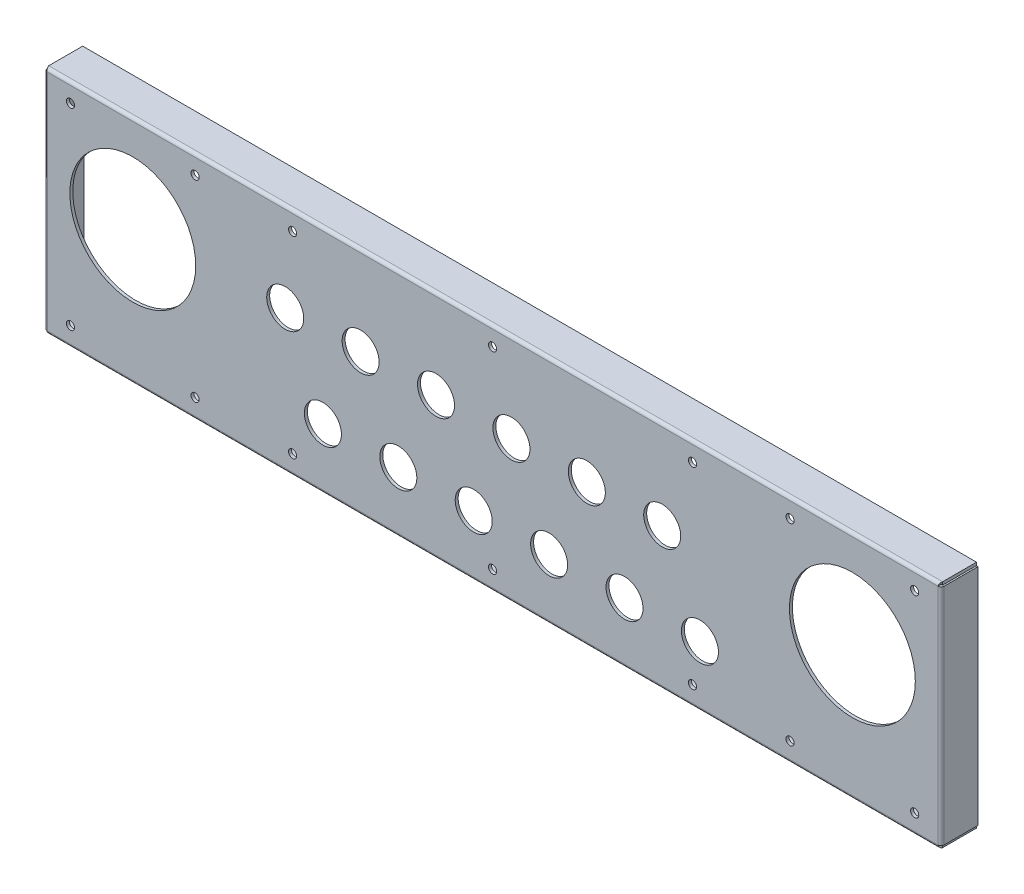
ISO-10303-21;
HEADER;
FILE_DESCRIPTION(('STEP AP214'),'2;1');
FILE_NAME('part.step','',(''),(''),'','','');
FILE_SCHEMA(('AUTOMOTIVE_DESIGN { 1 0 10303 214 1 1 1 1 }'));
ENDSEC;
DATA;
#1=APPLICATION_CONTEXT('core data for automotive mechanical design processes');
#2=APPLICATION_PROTOCOL_DEFINITION('international standard','automotive_design',2000,#1);
#3=PRODUCT_CONTEXT('',#1,'mechanical');
#4=PRODUCT('Part','Part','',(#3));
#5=PRODUCT_RELATED_PRODUCT_CATEGORY('part','',(#4));
#6=PRODUCT_DEFINITION_FORMATION('','',#4);
#7=PRODUCT_DEFINITION_CONTEXT('part definition',#1,'design');
#8=PRODUCT_DEFINITION('design','',#6,#7);
#9=PRODUCT_DEFINITION_SHAPE('','',#8);
#10=(LENGTH_UNIT() NAMED_UNIT(*) SI_UNIT(.MILLI.,.METRE.));
#11=(NAMED_UNIT(*) PLANE_ANGLE_UNIT() SI_UNIT($,.RADIAN.));
#12=(NAMED_UNIT(*) SI_UNIT($,.STERADIAN.) SOLID_ANGLE_UNIT());
#13=UNCERTAINTY_MEASURE_WITH_UNIT(LENGTH_MEASURE(1.E-05),#10,'distance_accuracy_value','');
#14=(GEOMETRIC_REPRESENTATION_CONTEXT(3) GLOBAL_UNCERTAINTY_ASSIGNED_CONTEXT((#13)) GLOBAL_UNIT_ASSIGNED_CONTEXT((#10,
#11,#12)) REPRESENTATION_CONTEXT('',''));
#15=CARTESIAN_POINT('',(0.,0.,0.));
#16=DIRECTION('',(0.,0.,1.));
#17=DIRECTION('',(1.,0.,0.));
#18=AXIS2_PLACEMENT_3D('',#15,#16,#17);
#19=CARTESIAN_POINT('',(-302.75,-77.7500000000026,-2.00000000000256));
#20=DIRECTION('',(0.,1.,0.));
#21=DIRECTION('',(0.,0.,1.));
#22=AXIS2_PLACEMENT_3D('',#19,#20,#21);
#23=PLANE('',#22);
#24=DIRECTION('',(1.,0.,0.));
#25=VECTOR('',#24,1.);
#26=CARTESIAN_POINT('',(302.75,-77.7500000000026,-2.10000000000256));
#27=LINE('',#26,#25);
#28=CARTESIAN_POINT('',(-254.600000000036,-77.7500000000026,-2.10000000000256));
#29=VERTEX_POINT('',#28);
#30=CARTESIAN_POINT('',(254.6,-77.75,-2.10000000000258));
#31=VERTEX_POINT('',#30);
#32=EDGE_CURVE('E218',#29,#31,#27,.T.);
#33=ORIENTED_EDGE('',*,*,#32,.F.);
#34=DIRECTION('',(0.,0.,-1.));
#35=VECTOR('',#34,1.);
#36=CARTESIAN_POINT('',(-254.600000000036,-77.7500000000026,-2.10000000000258));
#37=LINE('',#36,#35);
#38=CARTESIAN_POINT('',(-254.600000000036,-77.7500000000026,-25.0000000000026));
#39=VERTEX_POINT('',#38);
#40=EDGE_CURVE('E1826',#29,#39,#37,.T.);
#41=ORIENTED_EDGE('',*,*,#40,.T.);
#42=DIRECTION('',(1.,0.,0.));
#43=VECTOR('',#42,1.);
#44=CARTESIAN_POINT('',(-302.75,-77.7500000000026,-25.0000000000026));
#45=LINE('',#44,#43);
#46=CARTESIAN_POINT('',(254.6,-77.7500000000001,-25.0000000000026));
#47=VERTEX_POINT('',#46);
#48=EDGE_CURVE('E1805',#39,#47,#45,.T.);
#49=ORIENTED_EDGE('',*,*,#48,.T.);
#50=DIRECTION('',(0.,0.,-1.));
#51=VECTOR('',#50,1.);
#52=CARTESIAN_POINT('',(254.6,-77.75,-2.10000000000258));
#53=LINE('',#52,#51);
#54=EDGE_CURVE('E1825',#31,#47,#53,.T.);
#55=ORIENTED_EDGE('',*,*,#54,.F.);
#56=EDGE_LOOP('',(#33,#41,#49,#55));
#57=FACE_BOUND('',#56,.T.);
#58=ADVANCED_FACE('F214',(#57),#23,.F.);
#59=CARTESIAN_POINT('',(255.4,-77.7500000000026,-2.10000000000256));
#60=VERTEX_POINT('',#59);
#61=CARTESIAN_POINT('',(301.75,-77.7500000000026,-2.10000000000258));
#62=VERTEX_POINT('',#61);
#63=EDGE_CURVE('E425',#60,#62,#27,.T.);
#64=ORIENTED_EDGE('',*,*,#63,.F.);
#65=DIRECTION('',(0.,0.,-1.));
#66=VECTOR('',#65,1.);
#67=CARTESIAN_POINT('',(255.4,-77.75,-2.10000000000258));
#68=LINE('',#67,#66);
#69=CARTESIAN_POINT('',(255.4,-77.7500000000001,-25.0000000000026));
#70=VERTEX_POINT('',#69);
#71=EDGE_CURVE('E1840',#60,#70,#68,.T.);
#72=ORIENTED_EDGE('',*,*,#71,.T.);
#73=CARTESIAN_POINT('',(301.75,-77.7500000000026,-25.0000000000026));
#74=VERTEX_POINT('',#73);
#75=EDGE_CURVE('E857',#70,#74,#45,.T.);
#76=ORIENTED_EDGE('',*,*,#75,.T.);
#77=DIRECTION('',(0.,0.,-1.));
#78=VECTOR('',#77,1.);
#79=CARTESIAN_POINT('',(301.75,-77.7500000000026,-2.10000000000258));
#80=LINE('',#79,#78);
#81=EDGE_CURVE('E854',#62,#74,#80,.T.);
#82=ORIENTED_EDGE('',*,*,#81,.F.);
#83=EDGE_LOOP('',(#64,#72,#76,#82));
#84=FACE_BOUND('',#83,.T.);
#85=ADVANCED_FACE('F855',(#84),#23,.F.);
#86=CARTESIAN_POINT('',(302.75,-77.7500000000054,-1.99999999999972));
#87=DIRECTION('',(0.,0.,1.));
#88=DIRECTION('',(1.,0.,0.));
#89=AXIS2_PLACEMENT_3D('',#86,#87,#88);
#90=PLANE('',#89);
#91=CARTESIAN_POINT('',(-114.545,-36.9500000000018,-1.99999999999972));
#92=DIRECTION('',(0.,0.,1.));
#93=DIRECTION('',(1.,0.,0.));
#94=AXIS2_PLACEMENT_3D('',#91,#92,#93);
#95=CIRCLE('',#94,12.5);
#96=CARTESIAN_POINT('',(-102.045,-36.9500000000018,-1.99999999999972));
#97=VERTEX_POINT('',#96);
#98=EDGE_CURVE('E1846',#97,#97,#95,.F.);
#99=ORIENTED_EDGE('',*,*,#98,.F.);
#100=EDGE_LOOP('',(#99));
#101=FACE_BOUND('',#100,.T.);
#102=CARTESIAN_POINT('',(-63.636,-36.9500000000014,-1.99999999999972));
#103=DIRECTION('',(0.,0.,1.));
#104=DIRECTION('',(1.,0.,0.));
#105=AXIS2_PLACEMENT_3D('',#102,#103,#104);
#106=CIRCLE('',#105,12.5);
#107=CARTESIAN_POINT('',(-51.136,-36.9500000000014,-1.99999999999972));
#108=VERTEX_POINT('',#107);
#109=EDGE_CURVE('E1852',#108,#108,#106,.F.);
#110=ORIENTED_EDGE('',*,*,#109,.F.);
#111=EDGE_LOOP('',(#110));
#112=FACE_BOUND('',#111,.T.);
#113=CARTESIAN_POINT('',(-12.727,-36.9500000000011,-1.99999999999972));
#114=DIRECTION('',(0.,0.,1.));
#115=DIRECTION('',(1.,0.,0.));
#116=AXIS2_PLACEMENT_3D('',#113,#114,#115);
#117=CIRCLE('',#116,12.5);
#118=CARTESIAN_POINT('',(-0.226999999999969,-36.9500000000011,-1.99999999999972));
#119=VERTEX_POINT('',#118);
#120=EDGE_CURVE('E1858',#119,#119,#117,.F.);
#121=ORIENTED_EDGE('',*,*,#120,.F.);
#122=EDGE_LOOP('',(#121));
#123=FACE_BOUND('',#122,.T.);
#124=CARTESIAN_POINT('',(38.182,-36.9500000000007,-1.99999999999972));
#125=DIRECTION('',(0.,0.,1.));
#126=DIRECTION('',(1.,0.,0.));
#127=AXIS2_PLACEMENT_3D('',#124,#125,#126);
#128=CIRCLE('',#127,12.5);
#129=CARTESIAN_POINT('',(50.682,-36.9500000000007,-1.99999999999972));
#130=VERTEX_POINT('',#129);
#131=EDGE_CURVE('E1864',#130,#130,#128,.F.);
#132=ORIENTED_EDGE('',*,*,#131,.F.);
#133=EDGE_LOOP('',(#132));
#134=FACE_BOUND('',#133,.T.);
#135=CARTESIAN_POINT('',(89.091,-36.9500000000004,-1.99999999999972));
#136=DIRECTION('',(0.,0.,1.));
#137=DIRECTION('',(1.,0.,0.));
#138=AXIS2_PLACEMENT_3D('',#135,#136,#137);
#139=CIRCLE('',#138,12.5);
#140=CARTESIAN_POINT('',(101.591,-36.9500000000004,-1.99999999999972));
#141=VERTEX_POINT('',#140);
#142=EDGE_CURVE('E1870',#141,#141,#139,.F.);
#143=ORIENTED_EDGE('',*,*,#142,.F.);
#144=EDGE_LOOP('',(#143));
#145=FACE_BOUND('',#144,.T.);
#146=CARTESIAN_POINT('',(114.545,18.05,-1.99999999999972));
#147=DIRECTION('',(0.,0.,1.));
#148=DIRECTION('',(1.,0.,0.));
#149=AXIS2_PLACEMENT_3D('',#146,#147,#148);
#150=CIRCLE('',#149,12.5);
#151=CARTESIAN_POINT('',(127.045,18.05,-1.99999999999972));
#152=VERTEX_POINT('',#151);
#153=EDGE_CURVE('E1876',#152,#152,#150,.F.);
#154=ORIENTED_EDGE('',*,*,#153,.F.);
#155=EDGE_LOOP('',(#154));
#156=FACE_BOUND('',#155,.T.);
#157=CARTESIAN_POINT('',(63.636,18.05,-1.99999999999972));
#158=DIRECTION('',(0.,0.,1.));
#159=DIRECTION('',(1.,0.,0.));
#160=AXIS2_PLACEMENT_3D('',#157,#158,#159);
#161=CIRCLE('',#160,12.5);
#162=CARTESIAN_POINT('',(76.136,18.05,-1.99999999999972));
#163=VERTEX_POINT('',#162);
#164=EDGE_CURVE('E1882',#163,#163,#161,.F.);
#165=ORIENTED_EDGE('',*,*,#164,.F.);
#166=EDGE_LOOP('',(#165));
#167=FACE_BOUND('',#166,.T.);
#168=CARTESIAN_POINT('',(12.727,18.05,-1.99999999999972));
#169=DIRECTION('',(0.,0.,1.));
#170=DIRECTION('',(1.,0.,0.));
#171=AXIS2_PLACEMENT_3D('',#168,#169,#170);
#172=CIRCLE('',#171,12.5);
#173=CARTESIAN_POINT('',(25.227,18.05,-1.99999999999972));
#174=VERTEX_POINT('',#173);
#175=EDGE_CURVE('E1888',#174,#174,#172,.F.);
#176=ORIENTED_EDGE('',*,*,#175,.F.);
#177=EDGE_LOOP('',(#176));
#178=FACE_BOUND('',#177,.T.);
#179=CARTESIAN_POINT('',(-38.182,18.05,-1.99999999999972));
#180=DIRECTION('',(0.,0.,1.));
#181=DIRECTION('',(1.,0.,0.));
#182=AXIS2_PLACEMENT_3D('',#179,#180,#181);
#183=CIRCLE('',#182,12.5);
#184=CARTESIAN_POINT('',(-25.682,18.05,-1.99999999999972));
#185=VERTEX_POINT('',#184);
#186=EDGE_CURVE('E1894',#185,#185,#183,.F.);
#187=ORIENTED_EDGE('',*,*,#186,.F.);
#188=EDGE_LOOP('',(#187));
#189=FACE_BOUND('',#188,.T.);
#190=CARTESIAN_POINT('',(-89.091,18.05,-1.99999999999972));
#191=DIRECTION('',(0.,0.,1.));
#192=DIRECTION('',(1.,0.,0.));
#193=AXIS2_PLACEMENT_3D('',#190,#191,#192);
#194=CIRCLE('',#193,12.5);
#195=CARTESIAN_POINT('',(-76.591,18.05,-1.99999999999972));
#196=VERTEX_POINT('',#195);
#197=EDGE_CURVE('E1900',#196,#196,#194,.F.);
#198=ORIENTED_EDGE('',*,*,#197,.F.);
#199=EDGE_LOOP('',(#198));
#200=FACE_BOUND('',#199,.T.);
#201=CARTESIAN_POINT('',(-140.,18.05,-1.99999999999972));
#202=DIRECTION('',(0.,0.,1.));
#203=DIRECTION('',(1.,0.,0.));
#204=AXIS2_PLACEMENT_3D('',#201,#202,#203);
#205=CIRCLE('',#204,12.5);
#206=CARTESIAN_POINT('',(-127.5,18.05,-1.99999999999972));
#207=VERTEX_POINT('',#206);
#208=EDGE_CURVE('E1906',#207,#207,#205,.F.);
#209=ORIENTED_EDGE('',*,*,#208,.F.);
#210=EDGE_LOOP('',(#209));
#211=FACE_BOUND('',#210,.T.);
#212=CARTESIAN_POINT('',(140.,-36.95,-1.99999999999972));
#213=DIRECTION('',(0.,0.,1.));
#214=DIRECTION('',(1.,0.,0.));
#215=AXIS2_PLACEMENT_3D('',#212,#213,#214);
#216=CIRCLE('',#215,12.5);
#217=CARTESIAN_POINT('',(152.5,-36.95,-1.99999999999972));
#218=VERTEX_POINT('',#217);
#219=EDGE_CURVE('E1912',#218,#218,#216,.F.);
#220=ORIENTED_EDGE('',*,*,#219,.F.);
#221=EDGE_LOOP('',(#220));
#222=FACE_BOUND('',#221,.T.);
#223=CARTESIAN_POINT('',(0.,65.2499999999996,-1.99999999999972));
#224=DIRECTION('',(0.,0.,1.));
#225=DIRECTION('',(1.,0.,0.));
#226=AXIS2_PLACEMENT_3D('',#223,#224,#225);
#227=CIRCLE('',#226,2.75);
#228=CARTESIAN_POINT('',(2.75,65.2499999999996,-1.99999999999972));
#229=VERTEX_POINT('',#228);
#230=EDGE_CURVE('E1918',#229,#229,#227,.F.);
#231=ORIENTED_EDGE('',*,*,#230,.F.);
#232=EDGE_LOOP('',(#231));
#233=FACE_BOUND('',#232,.T.);
#234=CARTESIAN_POINT('',(0.,-64.7500000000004,-1.99999999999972));
#235=DIRECTION('',(0.,0.,1.));
#236=DIRECTION('',(1.,0.,0.));
#237=AXIS2_PLACEMENT_3D('',#234,#235,#236);
#238=CIRCLE('',#237,2.75);
#239=CARTESIAN_POINT('',(2.75000000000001,-64.7500000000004,-1.99999999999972));
#240=VERTEX_POINT('',#239);
#241=EDGE_CURVE('E1924',#240,#240,#238,.F.);
#242=ORIENTED_EDGE('',*,*,#241,.F.);
#243=EDGE_LOOP('',(#242));
#244=FACE_BOUND('',#243,.T.);
#245=CARTESIAN_POINT('',(-135.,-64.7500000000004,-1.99999999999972));
#246=DIRECTION('',(0.,0.,1.));
#247=DIRECTION('',(1.,0.,0.));
#248=AXIS2_PLACEMENT_3D('',#245,#246,#247);
#249=CIRCLE('',#248,2.75000000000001);
#250=CARTESIAN_POINT('',(-132.25,-64.7500000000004,-1.99999999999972));
#251=VERTEX_POINT('',#250);
#252=EDGE_CURVE('E1930',#251,#251,#249,.F.);
#253=ORIENTED_EDGE('',*,*,#252,.F.);
#254=EDGE_LOOP('',(#253));
#255=FACE_BOUND('',#254,.T.);
#256=CARTESIAN_POINT('',(135.,-64.7500000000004,-1.99999999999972));
#257=DIRECTION('',(0.,0.,1.));
#258=DIRECTION('',(1.,0.,0.));
#259=AXIS2_PLACEMENT_3D('',#256,#257,#258);
#260=CIRCLE('',#259,2.75000000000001);
#261=CARTESIAN_POINT('',(137.75,-64.7500000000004,-1.99999999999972));
#262=VERTEX_POINT('',#261);
#263=EDGE_CURVE('E1936',#262,#262,#260,.F.);
#264=ORIENTED_EDGE('',*,*,#263,.F.);
#265=EDGE_LOOP('',(#264));
#266=FACE_BOUND('',#265,.T.);
#267=CARTESIAN_POINT('',(135.,65.2499999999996,-1.99999999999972));
#268=DIRECTION('',(0.,0.,1.));
#269=DIRECTION('',(1.,0.,0.));
#270=AXIS2_PLACEMENT_3D('',#267,#268,#269);
#271=CIRCLE('',#270,2.75000000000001);
#272=CARTESIAN_POINT('',(137.75,65.2499999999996,-1.99999999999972));
#273=VERTEX_POINT('',#272);
#274=EDGE_CURVE('E1942',#273,#273,#271,.F.);
#275=ORIENTED_EDGE('',*,*,#274,.F.);
#276=EDGE_LOOP('',(#275));
#277=FACE_BOUND('',#276,.T.);
#278=CARTESIAN_POINT('',(-135.,65.2499999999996,-1.99999999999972));
#279=DIRECTION('',(0.,0.,1.));
#280=DIRECTION('',(1.,0.,0.));
#281=AXIS2_PLACEMENT_3D('',#278,#279,#280);
#282=CIRCLE('',#281,2.75000000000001);
#283=CARTESIAN_POINT('',(-132.25,65.2499999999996,-1.99999999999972));
#284=VERTEX_POINT('',#283);
#285=EDGE_CURVE('E1948',#284,#284,#282,.F.);
#286=ORIENTED_EDGE('',*,*,#285,.F.);
#287=EDGE_LOOP('',(#286));
#288=FACE_BOUND('',#287,.T.);
#289=CARTESIAN_POINT('',(200.859500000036,-64.7500000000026,-1.99999999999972));
#290=DIRECTION('',(0.,0.,1.));
#291=DIRECTION('',(1.,0.,0.));
#292=AXIS2_PLACEMENT_3D('',#289,#290,#291);
#293=CIRCLE('',#292,2.75000000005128);
#294=CARTESIAN_POINT('',(203.609500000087,-64.7500000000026,-1.99999999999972));
#295=VERTEX_POINT('',#294);
#296=EDGE_CURVE('E1955',#295,#295,#293,.T.);
#297=ORIENTED_EDGE('',*,*,#296,.T.);
#298=EDGE_LOOP('',(#297));
#299=FACE_BOUND('',#298,.T.);
#300=CARTESIAN_POINT('',(285.000500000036,65.2499999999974,-1.99999999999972));
#301=DIRECTION('',(0.,0.,1.));
#302=DIRECTION('',(1.,0.,0.));
#303=AXIS2_PLACEMENT_3D('',#300,#301,#302);
#304=CIRCLE('',#303,2.75000000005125);
#305=CARTESIAN_POINT('',(287.750500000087,65.2499999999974,-1.99999999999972));
#306=VERTEX_POINT('',#305);
#307=EDGE_CURVE('E1967',#306,#306,#304,.T.);
#308=ORIENTED_EDGE('',*,*,#307,.T.);
#309=EDGE_LOOP('',(#308));
#310=FACE_BOUND('',#309,.T.);
#311=DIRECTION('',(0.,1.,0.));
#312=VECTOR('',#311,1.);
#313=CARTESIAN_POINT('',(300.65,-75.6792893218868,-1.99999999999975));
#314=LINE('',#313,#312);
#315=CARTESIAN_POINT('',(300.64999999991,-75.6500000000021,-1.99999999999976));
#316=VERTEX_POINT('',#315);
#317=CARTESIAN_POINT('',(300.65,75.6499999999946,-1.99999999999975));
#318=VERTEX_POINT('',#317);
#319=EDGE_CURVE('E599',#316,#318,#314,.T.);
#320=ORIENTED_EDGE('',*,*,#319,.F.);
#321=DIRECTION('',(1.,0.,0.));
#322=VECTOR('',#321,1.);
#323=CARTESIAN_POINT('',(-300.679289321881,-75.6500000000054,-1.99999999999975));
#324=LINE('',#323,#322);
#325=CARTESIAN_POINT('',(-300.65,-75.6500000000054,-1.99999999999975));
#326=VERTEX_POINT('',#325);
#327=EDGE_CURVE('E837',#326,#316,#324,.T.);
#328=ORIENTED_EDGE('',*,*,#327,.F.);
#329=DIRECTION('',(0.,-1.,0.));
#330=VECTOR('',#329,1.);
#331=CARTESIAN_POINT('',(-300.65,75.679289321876,-1.99999999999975));
#332=LINE('',#331,#330);
#333=CARTESIAN_POINT('',(-300.65,75.6499999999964,-1.99999999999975));
#334=VERTEX_POINT('',#333);
#335=EDGE_CURVE('E1679',#334,#326,#332,.T.);
#336=ORIENTED_EDGE('',*,*,#335,.F.);
#337=DIRECTION('',(-1.,0.,0.));
#338=VECTOR('',#337,1.);
#339=CARTESIAN_POINT('',(300.679289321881,75.6499999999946,-1.99999999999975));
#340=LINE('',#339,#338);
#341=EDGE_CURVE('E1671',#318,#334,#340,.T.);
#342=ORIENTED_EDGE('',*,*,#341,.F.);
#343=EDGE_LOOP('',(#320,#328,#336,#342));
#344=FACE_BOUND('',#343,.T.);
#345=CARTESIAN_POINT('',(-242.930000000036,12.4499999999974,-1.99999999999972));
#346=DIRECTION('',(0.,0.,1.));
#347=DIRECTION('',(1.,0.,0.));
#348=AXIS2_PLACEMENT_3D('',#345,#346,#347);
#349=CIRCLE('',#348,42.5000000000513);
#350=CARTESIAN_POINT('',(-200.429999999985,12.4499999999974,-1.99999999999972));
#351=VERTEX_POINT('',#350);
#352=EDGE_CURVE('E555',#351,#351,#349,.F.);
#353=ORIENTED_EDGE('',*,*,#352,.F.);
#354=EDGE_LOOP('',(#353));
#355=FACE_BOUND('',#354,.T.);
#356=CARTESIAN_POINT('',(-285.000500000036,65.2499999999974,-1.99999999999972));
#357=DIRECTION('',(0.,0.,1.));
#358=DIRECTION('',(1.,0.,0.));
#359=AXIS2_PLACEMENT_3D('',#356,#357,#358);
#360=CIRCLE('',#359,2.75000000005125);
#361=CARTESIAN_POINT('',(-282.250499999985,65.2499999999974,-1.99999999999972));
#362=VERTEX_POINT('',#361);
#363=EDGE_CURVE('E563',#362,#362,#360,.F.);
#364=ORIENTED_EDGE('',*,*,#363,.F.);
#365=EDGE_LOOP('',(#364));
#366=FACE_BOUND('',#365,.T.);
#367=CARTESIAN_POINT('',(-200.859500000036,65.2499999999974,-1.99999999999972));
#368=DIRECTION('',(0.,0.,1.));
#369=DIRECTION('',(1.,0.,0.));
#370=AXIS2_PLACEMENT_3D('',#367,#368,#369);
#371=CIRCLE('',#370,2.75000000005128);
#372=CARTESIAN_POINT('',(-198.109499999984,65.2499999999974,-1.99999999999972));
#373=VERTEX_POINT('',#372);
#374=EDGE_CURVE('E1996',#373,#373,#371,.F.);
#375=ORIENTED_EDGE('',*,*,#374,.F.);
#376=EDGE_LOOP('',(#375));
#377=FACE_BOUND('',#376,.T.);
#378=CARTESIAN_POINT('',(-200.859500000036,-64.7500000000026,-1.99999999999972));
#379=DIRECTION('',(0.,0.,1.));
#380=DIRECTION('',(1.,0.,0.));
#381=AXIS2_PLACEMENT_3D('',#378,#379,#380);
#382=CIRCLE('',#381,2.75000000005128);
#383=CARTESIAN_POINT('',(-198.109499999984,-64.7500000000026,-1.99999999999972));
#384=VERTEX_POINT('',#383);
#385=EDGE_CURVE('E1990',#384,#384,#382,.F.);
#386=ORIENTED_EDGE('',*,*,#385,.F.);
#387=EDGE_LOOP('',(#386));
#388=FACE_BOUND('',#387,.T.);
#389=CARTESIAN_POINT('',(-285.000500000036,-64.7500000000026,-1.99999999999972));
#390=DIRECTION('',(0.,0.,1.));
#391=DIRECTION('',(1.,0.,0.));
#392=AXIS2_PLACEMENT_3D('',#389,#390,#391);
#393=CIRCLE('',#392,2.75000000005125);
#394=CARTESIAN_POINT('',(-282.250499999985,-64.7500000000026,-1.99999999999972));
#395=VERTEX_POINT('',#394);
#396=EDGE_CURVE('E1984',#395,#395,#393,.F.);
#397=ORIENTED_EDGE('',*,*,#396,.F.);
#398=EDGE_LOOP('',(#397));
#399=FACE_BOUND('',#398,.T.);
#400=CARTESIAN_POINT('',(242.930000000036,12.4499999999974,-1.99999999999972));
#401=DIRECTION('',(0.,0.,1.));
#402=DIRECTION('',(1.,0.,0.));
#403=AXIS2_PLACEMENT_3D('',#400,#401,#402);
#404=CIRCLE('',#403,42.5000000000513);
#405=CARTESIAN_POINT('',(285.430000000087,12.4499999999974,-1.99999999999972));
#406=VERTEX_POINT('',#405);
#407=EDGE_CURVE('E1973',#406,#406,#404,.T.);
#408=ORIENTED_EDGE('',*,*,#407,.T.);
#409=EDGE_LOOP('',(#408));
#410=FACE_BOUND('',#409,.T.);
#411=CARTESIAN_POINT('',(200.859500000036,65.2499999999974,-1.99999999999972));
#412=DIRECTION('',(0.,0.,1.));
#413=DIRECTION('',(1.,0.,0.));
#414=AXIS2_PLACEMENT_3D('',#411,#412,#413);
#415=CIRCLE('',#414,2.75000000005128);
#416=CARTESIAN_POINT('',(203.609500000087,65.2499999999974,-1.99999999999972));
#417=VERTEX_POINT('',#416);
#418=EDGE_CURVE('E1961',#417,#417,#415,.T.);
#419=ORIENTED_EDGE('',*,*,#418,.T.);
#420=EDGE_LOOP('',(#419));
#421=FACE_BOUND('',#420,.T.);
#422=CARTESIAN_POINT('',(285.000500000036,-64.7500000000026,-1.99999999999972));
#423=DIRECTION('',(0.,0.,1.));
#424=DIRECTION('',(1.,0.,0.));
#425=AXIS2_PLACEMENT_3D('',#422,#423,#424);
#426=CIRCLE('',#425,2.75000000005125);
#427=CARTESIAN_POINT('',(287.750500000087,-64.7500000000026,-1.99999999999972));
#428=VERTEX_POINT('',#427);
#429=EDGE_CURVE('E1951',#428,#428,#426,.T.);
#430=ORIENTED_EDGE('',*,*,#429,.T.);
#431=EDGE_LOOP('',(#430));
#432=FACE_BOUND('',#431,.T.);
#433=ADVANCED_FACE('F898',(#101,#112,#123,#134,#145,#156,#167,#178,#189,#200,#211,#222,#233,
#244,#255,#266,#277,#288,#299,#310,#344,#355,#366,#377,#388,#399,#410,#421,#432),#90,.F.);
#434=CARTESIAN_POINT('',(302.75,-77.7500000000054,2.77555756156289E-13));
#435=DIRECTION('',(0.,0.,1.));
#436=DIRECTION('',(1.,0.,0.));
#437=AXIS2_PLACEMENT_3D('',#434,#435,#436);
#438=PLANE('',#437);
#439=CARTESIAN_POINT('',(-114.545,-36.9500000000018,0.));
#440=DIRECTION('',(0.,0.,1.));
#441=DIRECTION('',(1.,0.,0.));
#442=AXIS2_PLACEMENT_3D('',#439,#440,#441);
#443=CIRCLE('',#442,12.5);
#444=CARTESIAN_POINT('',(-102.045,-36.9500000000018,0.));
#445=VERTEX_POINT('',#444);
#446=EDGE_CURVE('E1842',#445,#445,#443,.T.);
#447=ORIENTED_EDGE('',*,*,#446,.F.);
#448=EDGE_LOOP('',(#447));
#449=FACE_BOUND('',#448,.T.);
#450=CARTESIAN_POINT('',(-63.636,-36.9500000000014,0.));
#451=DIRECTION('',(0.,0.,1.));
#452=DIRECTION('',(1.,0.,0.));
#453=AXIS2_PLACEMENT_3D('',#450,#451,#452);
#454=CIRCLE('',#453,12.5);
#455=CARTESIAN_POINT('',(-51.136,-36.9500000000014,0.));
#456=VERTEX_POINT('',#455);
#457=EDGE_CURVE('E1849',#456,#456,#454,.T.);
#458=ORIENTED_EDGE('',*,*,#457,.F.);
#459=EDGE_LOOP('',(#458));
#460=FACE_BOUND('',#459,.T.);
#461=CARTESIAN_POINT('',(-12.727,-36.9500000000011,0.));
#462=DIRECTION('',(0.,0.,1.));
#463=DIRECTION('',(1.,0.,0.));
#464=AXIS2_PLACEMENT_3D('',#461,#462,#463);
#465=CIRCLE('',#464,12.5);
#466=CARTESIAN_POINT('',(-0.226999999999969,-36.9500000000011,0.));
#467=VERTEX_POINT('',#466);
#468=EDGE_CURVE('E1855',#467,#467,#465,.T.);
#469=ORIENTED_EDGE('',*,*,#468,.F.);
#470=EDGE_LOOP('',(#469));
#471=FACE_BOUND('',#470,.T.);
#472=CARTESIAN_POINT('',(38.182,-36.9500000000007,0.));
#473=DIRECTION('',(0.,0.,1.));
#474=DIRECTION('',(1.,0.,0.));
#475=AXIS2_PLACEMENT_3D('',#472,#473,#474);
#476=CIRCLE('',#475,12.5);
#477=CARTESIAN_POINT('',(50.682,-36.9500000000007,0.));
#478=VERTEX_POINT('',#477);
#479=EDGE_CURVE('E1861',#478,#478,#476,.T.);
#480=ORIENTED_EDGE('',*,*,#479,.F.);
#481=EDGE_LOOP('',(#480));
#482=FACE_BOUND('',#481,.T.);
#483=CARTESIAN_POINT('',(89.091,-36.9500000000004,0.));
#484=DIRECTION('',(0.,0.,1.));
#485=DIRECTION('',(1.,0.,0.));
#486=AXIS2_PLACEMENT_3D('',#483,#484,#485);
#487=CIRCLE('',#486,12.5);
#488=CARTESIAN_POINT('',(101.591,-36.9500000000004,0.));
#489=VERTEX_POINT('',#488);
#490=EDGE_CURVE('E1867',#489,#489,#487,.T.);
#491=ORIENTED_EDGE('',*,*,#490,.F.);
#492=EDGE_LOOP('',(#491));
#493=FACE_BOUND('',#492,.T.);
#494=CARTESIAN_POINT('',(114.545,18.05,0.));
#495=DIRECTION('',(0.,0.,1.));
#496=DIRECTION('',(1.,0.,0.));
#497=AXIS2_PLACEMENT_3D('',#494,#495,#496);
#498=CIRCLE('',#497,12.5);
#499=CARTESIAN_POINT('',(127.045,18.05,0.));
#500=VERTEX_POINT('',#499);
#501=EDGE_CURVE('E1873',#500,#500,#498,.T.);
#502=ORIENTED_EDGE('',*,*,#501,.F.);
#503=EDGE_LOOP('',(#502));
#504=FACE_BOUND('',#503,.T.);
#505=CARTESIAN_POINT('',(63.636,18.05,0.));
#506=DIRECTION('',(0.,0.,1.));
#507=DIRECTION('',(1.,0.,0.));
#508=AXIS2_PLACEMENT_3D('',#505,#506,#507);
#509=CIRCLE('',#508,12.5);
#510=CARTESIAN_POINT('',(76.136,18.05,0.));
#511=VERTEX_POINT('',#510);
#512=EDGE_CURVE('E1879',#511,#511,#509,.T.);
#513=ORIENTED_EDGE('',*,*,#512,.F.);
#514=EDGE_LOOP('',(#513));
#515=FACE_BOUND('',#514,.T.);
#516=CARTESIAN_POINT('',(12.727,18.05,0.));
#517=DIRECTION('',(0.,0.,1.));
#518=DIRECTION('',(1.,0.,0.));
#519=AXIS2_PLACEMENT_3D('',#516,#517,#518);
#520=CIRCLE('',#519,12.5);
#521=CARTESIAN_POINT('',(25.227,18.05,0.));
#522=VERTEX_POINT('',#521);
#523=EDGE_CURVE('E1885',#522,#522,#520,.T.);
#524=ORIENTED_EDGE('',*,*,#523,.F.);
#525=EDGE_LOOP('',(#524));
#526=FACE_BOUND('',#525,.T.);
#527=CARTESIAN_POINT('',(-38.182,18.05,0.));
#528=DIRECTION('',(0.,0.,1.));
#529=DIRECTION('',(1.,0.,0.));
#530=AXIS2_PLACEMENT_3D('',#527,#528,#529);
#531=CIRCLE('',#530,12.5);
#532=CARTESIAN_POINT('',(-25.682,18.05,0.));
#533=VERTEX_POINT('',#532);
#534=EDGE_CURVE('E1891',#533,#533,#531,.T.);
#535=ORIENTED_EDGE('',*,*,#534,.F.);
#536=EDGE_LOOP('',(#535));
#537=FACE_BOUND('',#536,.T.);
#538=CARTESIAN_POINT('',(-89.091,18.05,0.));
#539=DIRECTION('',(0.,0.,1.));
#540=DIRECTION('',(1.,0.,0.));
#541=AXIS2_PLACEMENT_3D('',#538,#539,#540);
#542=CIRCLE('',#541,12.5);
#543=CARTESIAN_POINT('',(-76.591,18.05,0.));
#544=VERTEX_POINT('',#543);
#545=EDGE_CURVE('E1897',#544,#544,#542,.T.);
#546=ORIENTED_EDGE('',*,*,#545,.F.);
#547=EDGE_LOOP('',(#546));
#548=FACE_BOUND('',#547,.T.);
#549=CARTESIAN_POINT('',(-140.,18.05,0.));
#550=DIRECTION('',(0.,0.,1.));
#551=DIRECTION('',(1.,0.,0.));
#552=AXIS2_PLACEMENT_3D('',#549,#550,#551);
#553=CIRCLE('',#552,12.5);
#554=CARTESIAN_POINT('',(-127.5,18.05,0.));
#555=VERTEX_POINT('',#554);
#556=EDGE_CURVE('E1903',#555,#555,#553,.T.);
#557=ORIENTED_EDGE('',*,*,#556,.F.);
#558=EDGE_LOOP('',(#557));
#559=FACE_BOUND('',#558,.T.);
#560=CARTESIAN_POINT('',(140.,-36.95,0.));
#561=DIRECTION('',(0.,0.,1.));
#562=DIRECTION('',(1.,0.,0.));
#563=AXIS2_PLACEMENT_3D('',#560,#561,#562);
#564=CIRCLE('',#563,12.5);
#565=CARTESIAN_POINT('',(152.5,-36.95,0.));
#566=VERTEX_POINT('',#565);
#567=EDGE_CURVE('E1909',#566,#566,#564,.T.);
#568=ORIENTED_EDGE('',*,*,#567,.F.);
#569=EDGE_LOOP('',(#568));
#570=FACE_BOUND('',#569,.T.);
#571=CARTESIAN_POINT('',(0.,65.2499999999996,0.));
#572=DIRECTION('',(0.,0.,1.));
#573=DIRECTION('',(1.,0.,0.));
#574=AXIS2_PLACEMENT_3D('',#571,#572,#573);
#575=CIRCLE('',#574,2.75);
#576=CARTESIAN_POINT('',(2.75,65.2499999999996,0.));
#577=VERTEX_POINT('',#576);
#578=EDGE_CURVE('E1915',#577,#577,#575,.T.);
#579=ORIENTED_EDGE('',*,*,#578,.F.);
#580=EDGE_LOOP('',(#579));
#581=FACE_BOUND('',#580,.T.);
#582=CARTESIAN_POINT('',(0.,-64.7500000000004,0.));
#583=DIRECTION('',(0.,0.,1.));
#584=DIRECTION('',(1.,0.,0.));
#585=AXIS2_PLACEMENT_3D('',#582,#583,#584);
#586=CIRCLE('',#585,2.75);
#587=CARTESIAN_POINT('',(2.75000000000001,-64.7500000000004,0.));
#588=VERTEX_POINT('',#587);
#589=EDGE_CURVE('E1921',#588,#588,#586,.T.);
#590=ORIENTED_EDGE('',*,*,#589,.F.);
#591=EDGE_LOOP('',(#590));
#592=FACE_BOUND('',#591,.T.);
#593=CARTESIAN_POINT('',(-135.,-64.7500000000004,0.));
#594=DIRECTION('',(0.,0.,1.));
#595=DIRECTION('',(1.,0.,0.));
#596=AXIS2_PLACEMENT_3D('',#593,#594,#595);
#597=CIRCLE('',#596,2.75000000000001);
#598=CARTESIAN_POINT('',(-132.25,-64.7500000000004,0.));
#599=VERTEX_POINT('',#598);
#600=EDGE_CURVE('E1927',#599,#599,#597,.T.);
#601=ORIENTED_EDGE('',*,*,#600,.F.);
#602=EDGE_LOOP('',(#601));
#603=FACE_BOUND('',#602,.T.);
#604=CARTESIAN_POINT('',(135.,-64.7500000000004,0.));
#605=DIRECTION('',(0.,0.,1.));
#606=DIRECTION('',(1.,0.,0.));
#607=AXIS2_PLACEMENT_3D('',#604,#605,#606);
#608=CIRCLE('',#607,2.75000000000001);
#609=CARTESIAN_POINT('',(137.75,-64.7500000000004,0.));
#610=VERTEX_POINT('',#609);
#611=EDGE_CURVE('E1933',#610,#610,#608,.T.);
#612=ORIENTED_EDGE('',*,*,#611,.F.);
#613=EDGE_LOOP('',(#612));
#614=FACE_BOUND('',#613,.T.);
#615=CARTESIAN_POINT('',(135.,65.2499999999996,0.));
#616=DIRECTION('',(0.,0.,1.));
#617=DIRECTION('',(1.,0.,0.));
#618=AXIS2_PLACEMENT_3D('',#615,#616,#617);
#619=CIRCLE('',#618,2.75000000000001);
#620=CARTESIAN_POINT('',(137.75,65.2499999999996,0.));
#621=VERTEX_POINT('',#620);
#622=EDGE_CURVE('E1939',#621,#621,#619,.T.);
#623=ORIENTED_EDGE('',*,*,#622,.F.);
#624=EDGE_LOOP('',(#623));
#625=FACE_BOUND('',#624,.T.);
#626=CARTESIAN_POINT('',(-135.,65.2499999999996,0.));
#627=DIRECTION('',(0.,0.,1.));
#628=DIRECTION('',(1.,0.,0.));
#629=AXIS2_PLACEMENT_3D('',#626,#627,#628);
#630=CIRCLE('',#629,2.75000000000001);
#631=CARTESIAN_POINT('',(-132.25,65.2499999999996,0.));
#632=VERTEX_POINT('',#631);
#633=EDGE_CURVE('E1945',#632,#632,#630,.T.);
#634=ORIENTED_EDGE('',*,*,#633,.F.);
#635=EDGE_LOOP('',(#634));
#636=FACE_BOUND('',#635,.T.);
#637=CARTESIAN_POINT('',(200.859500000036,-64.7500000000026,0.));
#638=DIRECTION('',(0.,0.,-1.));
#639=DIRECTION('',(-1.,0.,0.));
#640=AXIS2_PLACEMENT_3D('',#637,#638,#639);
#641=CIRCLE('',#640,2.75000000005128);
#642=CARTESIAN_POINT('',(198.109499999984,-64.7500000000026,0.));
#643=VERTEX_POINT('',#642);
#644=EDGE_CURVE('E1958',#643,#643,#641,.T.);
#645=ORIENTED_EDGE('',*,*,#644,.T.);
#646=EDGE_LOOP('',(#645));
#647=FACE_BOUND('',#646,.T.);
#648=CARTESIAN_POINT('',(285.000500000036,65.2499999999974,0.));
#649=DIRECTION('',(0.,0.,-1.));
#650=DIRECTION('',(-1.,0.,0.));
#651=AXIS2_PLACEMENT_3D('',#648,#649,#650);
#652=CIRCLE('',#651,2.75000000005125);
#653=CARTESIAN_POINT('',(282.250499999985,65.2499999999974,0.));
#654=VERTEX_POINT('',#653);
#655=EDGE_CURVE('E1970',#654,#654,#652,.T.);
#656=ORIENTED_EDGE('',*,*,#655,.T.);
#657=EDGE_LOOP('',(#656));
#658=FACE_BOUND('',#657,.T.);
#659=DIRECTION('',(1.,0.,0.));
#660=VECTOR('',#659,1.);
#661=CARTESIAN_POINT('',(-300.679289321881,-75.6500000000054,2.4980018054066E-13));
#662=LINE('',#661,#660);
#663=CARTESIAN_POINT('',(-300.65,-75.6500000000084,2.4980018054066E-13));
#664=VERTEX_POINT('',#663);
#665=CARTESIAN_POINT('',(300.64999999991,-75.6500000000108,2.4980018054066E-13));
#666=VERTEX_POINT('',#665);
#667=EDGE_CURVE('E603',#664,#666,#662,.T.);
#668=ORIENTED_EDGE('',*,*,#667,.T.);
#669=DIRECTION('',(0.,1.,0.));
#670=VECTOR('',#669,1.);
#671=CARTESIAN_POINT('',(300.65,-75.6792893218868,2.4980018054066E-13));
#672=LINE('',#671,#670);
#673=CARTESIAN_POINT('',(300.65,75.6499999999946,2.4980018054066E-13));
#674=VERTEX_POINT('',#673);
#675=EDGE_CURVE('E224',#666,#674,#672,.T.);
#676=ORIENTED_EDGE('',*,*,#675,.T.);
#677=DIRECTION('',(-1.,0.,0.));
#678=VECTOR('',#677,1.);
#679=CARTESIAN_POINT('',(300.679289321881,75.6499999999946,2.4980018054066E-13));
#680=LINE('',#679,#678);
#681=CARTESIAN_POINT('',(-300.649999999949,75.6499999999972,2.4980018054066E-13));
#682=VERTEX_POINT('',#681);
#683=EDGE_CURVE('E1674',#674,#682,#680,.T.);
#684=ORIENTED_EDGE('',*,*,#683,.T.);
#685=DIRECTION('',(0.,-1.,0.));
#686=VECTOR('',#685,1.);
#687=CARTESIAN_POINT('',(-300.65,75.6792893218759,2.4980018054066E-13));
#688=LINE('',#687,#686);
#689=EDGE_CURVE('E845',#682,#664,#688,.T.);
#690=ORIENTED_EDGE('',*,*,#689,.T.);
#691=EDGE_LOOP('',(#668,#676,#684,#690));
#692=FACE_BOUND('',#691,.T.);
#693=CARTESIAN_POINT('',(-242.930000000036,12.4499999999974,0.));
#694=DIRECTION('',(0.,0.,1.));
#695=DIRECTION('',(1.,0.,0.));
#696=AXIS2_PLACEMENT_3D('',#693,#694,#695);
#697=CIRCLE('',#696,42.5000000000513);
#698=CARTESIAN_POINT('',(-200.429999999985,12.4499999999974,0.));
#699=VERTEX_POINT('',#698);
#700=EDGE_CURVE('E558',#699,#699,#697,.T.);
#701=ORIENTED_EDGE('',*,*,#700,.F.);
#702=EDGE_LOOP('',(#701));
#703=FACE_BOUND('',#702,.T.);
#704=CARTESIAN_POINT('',(-285.000500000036,65.2499999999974,0.));
#705=DIRECTION('',(0.,0.,1.));
#706=DIRECTION('',(1.,0.,0.));
#707=AXIS2_PLACEMENT_3D('',#704,#705,#706);
#708=CIRCLE('',#707,2.75000000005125);
#709=CARTESIAN_POINT('',(-282.250499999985,65.2499999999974,0.));
#710=VERTEX_POINT('',#709);
#711=EDGE_CURVE('E1999',#710,#710,#708,.T.);
#712=ORIENTED_EDGE('',*,*,#711,.F.);
#713=EDGE_LOOP('',(#712));
#714=FACE_BOUND('',#713,.T.);
#715=CARTESIAN_POINT('',(-200.859500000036,65.2499999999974,0.));
#716=DIRECTION('',(0.,0.,1.));
#717=DIRECTION('',(1.,0.,0.));
#718=AXIS2_PLACEMENT_3D('',#715,#716,#717);
#719=CIRCLE('',#718,2.75000000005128);
#720=CARTESIAN_POINT('',(-198.109499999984,65.2499999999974,0.));
#721=VERTEX_POINT('',#720);
#722=EDGE_CURVE('E1993',#721,#721,#719,.T.);
#723=ORIENTED_EDGE('',*,*,#722,.F.);
#724=EDGE_LOOP('',(#723));
#725=FACE_BOUND('',#724,.T.);
#726=CARTESIAN_POINT('',(-200.859500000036,-64.7500000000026,0.));
#727=DIRECTION('',(0.,0.,1.));
#728=DIRECTION('',(1.,0.,0.));
#729=AXIS2_PLACEMENT_3D('',#726,#727,#728);
#730=CIRCLE('',#729,2.75000000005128);
#731=CARTESIAN_POINT('',(-198.109499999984,-64.7500000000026,0.));
#732=VERTEX_POINT('',#731);
#733=EDGE_CURVE('E1987',#732,#732,#730,.T.);
#734=ORIENTED_EDGE('',*,*,#733,.F.);
#735=EDGE_LOOP('',(#734));
#736=FACE_BOUND('',#735,.T.);
#737=CARTESIAN_POINT('',(-285.000500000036,-64.7500000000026,0.));
#738=DIRECTION('',(0.,0.,1.));
#739=DIRECTION('',(1.,0.,0.));
#740=AXIS2_PLACEMENT_3D('',#737,#738,#739);
#741=CIRCLE('',#740,2.75000000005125);
#742=CARTESIAN_POINT('',(-282.250499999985,-64.7500000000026,0.));
#743=VERTEX_POINT('',#742);
#744=EDGE_CURVE('E1979',#743,#743,#741,.T.);
#745=ORIENTED_EDGE('',*,*,#744,.F.);
#746=EDGE_LOOP('',(#745));
#747=FACE_BOUND('',#746,.T.);
#748=CARTESIAN_POINT('',(242.930000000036,12.4499999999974,0.));
#749=DIRECTION('',(0.,0.,-1.));
#750=DIRECTION('',(-1.,0.,0.));
#751=AXIS2_PLACEMENT_3D('',#748,#749,#750);
#752=CIRCLE('',#751,42.5000000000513);
#753=CARTESIAN_POINT('',(200.429999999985,12.4499999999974,0.));
#754=VERTEX_POINT('',#753);
#755=EDGE_CURVE('E1976',#754,#754,#752,.T.);
#756=ORIENTED_EDGE('',*,*,#755,.T.);
#757=EDGE_LOOP('',(#756));
#758=FACE_BOUND('',#757,.T.);
#759=CARTESIAN_POINT('',(200.859500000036,65.2499999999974,0.));
#760=DIRECTION('',(0.,0.,-1.));
#761=DIRECTION('',(-1.,0.,0.));
#762=AXIS2_PLACEMENT_3D('',#759,#760,#761);
#763=CIRCLE('',#762,2.75000000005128);
#764=CARTESIAN_POINT('',(198.109499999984,65.2499999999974,0.));
#765=VERTEX_POINT('',#764);
#766=EDGE_CURVE('E1964',#765,#765,#763,.T.);
#767=ORIENTED_EDGE('',*,*,#766,.T.);
#768=EDGE_LOOP('',(#767));
#769=FACE_BOUND('',#768,.T.);
#770=CARTESIAN_POINT('',(285.000500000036,-64.7500000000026,0.));
#771=DIRECTION('',(0.,0.,-1.));
#772=DIRECTION('',(-1.,0.,0.));
#773=AXIS2_PLACEMENT_3D('',#770,#771,#772);
#774=CIRCLE('',#773,2.75000000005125);
#775=CARTESIAN_POINT('',(282.250499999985,-64.7500000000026,0.));
#776=VERTEX_POINT('',#775);
#777=EDGE_CURVE('E1952',#776,#776,#774,.T.);
#778=ORIENTED_EDGE('',*,*,#777,.T.);
#779=EDGE_LOOP('',(#778));
#780=FACE_BOUND('',#779,.T.);
#781=ADVANCED_FACE('F216',(#449,#460,#471,#482,#493,#504,#515,#526,#537,#548,#559,#570,#581,
#592,#603,#614,#625,#636,#647,#658,#692,#703,#714,#725,#736,#747,#758,#769,#780),#438,.T.);
#782=CARTESIAN_POINT('',(-302.75,77.7499999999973,-24.9999999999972));
#783=DIRECTION('',(0.,0.,1.));
#784=DIRECTION('',(0.,-1.,0.));
#785=AXIS2_PLACEMENT_3D('',#782,#783,#784);
#786=PLANE('',#785);
#787=DIRECTION('',(1.,0.,0.));
#788=VECTOR('',#787,1.);
#789=CARTESIAN_POINT('',(-302.75,75.7499999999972,-24.9999999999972));
#790=LINE('',#789,#788);
#791=CARTESIAN_POINT('',(301.75,75.7499999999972,-24.9999999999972));
#792=VERTEX_POINT('',#791);
#793=CARTESIAN_POINT('',(-301.75,75.7499999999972,-24.9999999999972));
#794=VERTEX_POINT('',#793);
#795=EDGE_CURVE('E1721',#792,#794,#790,.F.);
#796=ORIENTED_EDGE('',*,*,#795,.T.);
#797=DIRECTION('',(0.,-1.,0.));
#798=VECTOR('',#797,1.);
#799=CARTESIAN_POINT('',(-301.75,77.7499999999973,-24.9999999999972));
#800=LINE('',#799,#798);
#801=CARTESIAN_POINT('',(-301.75,77.7499999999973,-24.9999999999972));
#802=VERTEX_POINT('',#801);
#803=EDGE_CURVE('E1667',#802,#794,#800,.T.);
#804=ORIENTED_EDGE('',*,*,#803,.F.);
#805=DIRECTION('',(-1.,0.,0.));
#806=VECTOR('',#805,1.);
#807=CARTESIAN_POINT('',(-302.75,77.7499999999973,-24.9999999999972));
#808=LINE('',#807,#806);
#809=CARTESIAN_POINT('',(301.75,77.7499999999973,-24.9999999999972));
#810=VERTEX_POINT('',#809);
#811=EDGE_CURVE('E1728',#810,#802,#808,.T.);
#812=ORIENTED_EDGE('',*,*,#811,.F.);
#813=DIRECTION('',(0.,-1.,0.));
#814=VECTOR('',#813,1.);
#815=CARTESIAN_POINT('',(301.75,77.7499999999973,-24.9999999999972));
#816=LINE('',#815,#814);
#817=EDGE_CURVE('E1718',#810,#792,#816,.T.);
#818=ORIENTED_EDGE('',*,*,#817,.T.);
#819=EDGE_LOOP('',(#796,#804,#812,#818));
#820=FACE_BOUND('',#819,.T.);
#821=ADVANCED_FACE('F1348',(#820),#786,.F.);
#822=CARTESIAN_POINT('',(-302.75,75.7499999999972,-1.99999999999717));
#823=DIRECTION('',(0.,-1.,0.));
#824=DIRECTION('',(0.,0.,-1.));
#825=AXIS2_PLACEMENT_3D('',#822,#823,#824);
#826=PLANE('',#825);
#827=DIRECTION('',(1.,0.,0.));
#828=VECTOR('',#827,1.);
#829=CARTESIAN_POINT('',(-302.75,75.7499999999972,-2.09999999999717));
#830=LINE('',#829,#828);
#831=CARTESIAN_POINT('',(-301.75,75.7499999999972,-2.09999999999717));
#832=VERTEX_POINT('',#831);
#833=CARTESIAN_POINT('',(301.75,75.7499999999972,-2.09999999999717));
#834=VERTEX_POINT('',#833);
#835=EDGE_CURVE('E1702',#832,#834,#830,.T.);
#836=ORIENTED_EDGE('',*,*,#835,.F.);
#837=DIRECTION('',(0.,0.,-1.));
#838=VECTOR('',#837,1.);
#839=CARTESIAN_POINT('',(-301.75,75.7499999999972,-2.09999999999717));
#840=LINE('',#839,#838);
#841=EDGE_CURVE('E1668',#832,#794,#840,.T.);
#842=ORIENTED_EDGE('',*,*,#841,.T.);
#843=ORIENTED_EDGE('',*,*,#795,.F.);
#844=DIRECTION('',(0.,0.,-1.));
#845=VECTOR('',#844,1.);
#846=CARTESIAN_POINT('',(301.75,75.7499999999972,-2.09999999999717));
#847=LINE('',#846,#845);
#848=EDGE_CURVE('E1735',#834,#792,#847,.T.);
#849=ORIENTED_EDGE('',*,*,#848,.F.);
#850=EDGE_LOOP('',(#836,#842,#843,#849));
#851=FACE_BOUND('',#850,.T.);
#852=ADVANCED_FACE('F1586',(#851),#826,.T.);
#853=CARTESIAN_POINT('',(-301.75,77.7499999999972,-2.09999999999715));
#854=DIRECTION('',(-1.,0.,0.));
#855=DIRECTION('',(0.,0.,1.));
#856=AXIS2_PLACEMENT_3D('',#853,#854,#855);
#857=PLANE('',#856);
#858=ORIENTED_EDGE('',*,*,#841,.F.);
#859=CARTESIAN_POINT('',(-301.75,77.7699999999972,-2.09999999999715));
#860=CARTESIAN_POINT('',(-301.75,77.7499999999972,-2.09999999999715));
#861=CARTESIAN_POINT('',(-301.75,75.7499999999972,-2.09999999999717));
#862=B_SPLINE_CURVE_WITH_KNOTS('',1,(#859,#860,#861),.UNSPECIFIED.,.F.,.F.,(2,1,2),(-0.01,0.,
1.),.UNSPECIFIED.);
#863=CARTESIAN_POINT('',(-301.75,77.7499999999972,-2.09999999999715));
#864=VERTEX_POINT('',#863);
#865=EDGE_CURVE('E1710',#864,#832,#862,.T.);
#866=ORIENTED_EDGE('',*,*,#865,.F.);
#867=DIRECTION('',(0.,0.,-1.));
#868=VECTOR('',#867,1.);
#869=CARTESIAN_POINT('',(-301.75,77.7499999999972,-2.09999999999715));
#870=LINE('',#869,#868);
#871=EDGE_CURVE('E1659',#864,#802,#870,.T.);
#872=ORIENTED_EDGE('',*,*,#871,.T.);
#873=ORIENTED_EDGE('',*,*,#803,.T.);
#874=EDGE_LOOP('',(#858,#866,#872,#873));
#875=FACE_BOUND('',#874,.T.);
#876=ADVANCED_FACE('F1576',(#875),#857,.T.);
#877=CARTESIAN_POINT('',(-302.75,77.7499999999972,-1.99999999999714));
#878=DIRECTION('',(0.,-1.,0.));
#879=DIRECTION('',(0.,0.,-1.));
#880=AXIS2_PLACEMENT_3D('',#877,#878,#879);
#881=PLANE('',#880);
#882=ORIENTED_EDGE('',*,*,#811,.T.);
#883=ORIENTED_EDGE('',*,*,#871,.F.);
#884=DIRECTION('',(-1.,0.,0.));
#885=VECTOR('',#884,1.);
#886=CARTESIAN_POINT('',(-302.75,77.7499999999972,-2.09999999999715));
#887=LINE('',#886,#885);
#888=CARTESIAN_POINT('',(301.75,77.7499999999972,-2.09999999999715));
#889=VERTEX_POINT('',#888);
#890=EDGE_CURVE('E1705',#889,#864,#887,.T.);
#891=ORIENTED_EDGE('',*,*,#890,.F.);
#892=DIRECTION('',(0.,0.,-1.));
#893=VECTOR('',#892,1.);
#894=CARTESIAN_POINT('',(301.75,77.7499999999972,-2.09999999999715));
#895=LINE('',#894,#893);
#896=EDGE_CURVE('E1730',#889,#810,#895,.T.);
#897=ORIENTED_EDGE('',*,*,#896,.T.);
#898=EDGE_LOOP('',(#882,#883,#891,#897));
#899=FACE_BOUND('',#898,.T.);
#900=ADVANCED_FACE('F1567',(#899),#881,.F.);
#901=CARTESIAN_POINT('',(301.75,77.7499999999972,-2.09999999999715));
#902=DIRECTION('',(-1.,0.,0.));
#903=DIRECTION('',(0.,0.,1.));
#904=AXIS2_PLACEMENT_3D('',#901,#902,#903);
#905=PLANE('',#904);
#906=ORIENTED_EDGE('',*,*,#848,.T.);
#907=ORIENTED_EDGE('',*,*,#817,.F.);
#908=ORIENTED_EDGE('',*,*,#896,.F.);
#909=CARTESIAN_POINT('',(301.75,75.7499999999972,-2.09999999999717));
#910=CARTESIAN_POINT('',(301.75,77.7499999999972,-2.09999999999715));
#911=CARTESIAN_POINT('',(301.75,77.7699999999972,-2.09999999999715));
#912=B_SPLINE_CURVE_WITH_KNOTS('',1,(#909,#910,#911),.UNSPECIFIED.,.F.,.F.,(2,1,2),(-0.01,0.99,
1.),.UNSPECIFIED.);
#913=EDGE_CURVE('E1675',#889,#834,#912,.F.);
#914=ORIENTED_EDGE('',*,*,#913,.T.);
#915=EDGE_LOOP('',(#906,#907,#908,#914));
#916=FACE_BOUND('',#915,.T.);
#917=ADVANCED_FACE('F1557',(#916),#905,.F.);
#918=CARTESIAN_POINT('',(301.75,77.7699999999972,-2.09999999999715));
#919=CARTESIAN_POINT('',(301.658318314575,77.7699999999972,-1.82244760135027));
#920=CARTESIAN_POINT('',(301.566666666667,77.714822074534,-1.54509448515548));
#921=CARTESIAN_POINT('',(301.383333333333,77.5024271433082,-1.03232776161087));
#922=CARTESIAN_POINT('',(301.291666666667,77.3452937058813,-0.7971609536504));
#923=CARTESIAN_POINT('',(301.108333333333,76.9528390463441,-0.404706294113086));
#924=CARTESIAN_POINT('',(301.016666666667,76.7176722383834,-0.247572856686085));
#925=CARTESIAN_POINT('',(300.833333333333,76.2049055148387,-0.035177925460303));
#926=CARTESIAN_POINT('',(300.741681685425,75.9275523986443,0.0200000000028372));
#927=CARTESIAN_POINT('',(300.65,75.6499999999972,0.0200000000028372));
#928=CARTESIAN_POINT('',(301.75,77.7499999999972,-2.09999999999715));
#929=CARTESIAN_POINT('',(301.658318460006,77.7499999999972,-1.82506604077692));
#930=CARTESIAN_POINT('',(301.566666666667,77.6953426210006,-1.55032944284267));
#931=CARTESIAN_POINT('',(301.383333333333,77.4849514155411,-1.04240014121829));
#932=CARTESIAN_POINT('',(301.291666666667,77.3293003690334,-0.8094518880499));
#933=CARTESIAN_POINT('',(301.108333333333,76.9405481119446,-0.420699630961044));
#934=CARTESIAN_POINT('',(301.016666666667,76.7075998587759,-0.26504858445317));
#935=CARTESIAN_POINT('',(300.833333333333,76.1996705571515,-0.0546573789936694));
#936=CARTESIAN_POINT('',(300.741681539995,75.9249339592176,2.83106871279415E-12));
#937=CARTESIAN_POINT('',(300.65,75.6499999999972,2.83106871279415E-12));
#938=CARTESIAN_POINT('',(301.75,75.7499999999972,-2.09999999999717));
#939=CARTESIAN_POINT('',(301.658333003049,75.7499999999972,-2.08690998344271));
#940=CARTESIAN_POINT('',(301.566666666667,75.747397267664,-2.07382521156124));
#941=CARTESIAN_POINT('',(301.383333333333,75.7373786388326,-2.04963810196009));
#942=CARTESIAN_POINT('',(301.291666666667,75.729966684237,-2.03854532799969));
#943=CARTESIAN_POINT('',(301.108333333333,75.7114546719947,-2.02003331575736));
#944=CARTESIAN_POINT('',(301.016666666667,75.7003618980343,-2.01262136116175));
#945=CARTESIAN_POINT('',(300.833333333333,75.6761747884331,-2.00260273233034));
#946=CARTESIAN_POINT('',(300.741666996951,75.6630900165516,-1.99999999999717));
#947=CARTESIAN_POINT('',(300.65,75.6499999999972,-1.99999999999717));
#948=B_SPLINE_SURFACE_WITH_KNOTS('',1,3,((#918,#919,#920,#921,#922,#923,#924,#925,#926,#927),
(#928,#929,#930,#931,#932,#933,#934,#935,#936,#937),(#938,#939,#940,#941,#942,#943,#944,#945,
#946,#947)),.UNSPECIFIED.,.F.,.F.,.F.,(2,1,2),(4,2,2,2,4),(-0.01,0.,1.),(0.,0.25,0.5,0.75,1.),.UNSPECIFIED.);
#949=CARTESIAN_POINT('',(301.75,77.7499999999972,-2.09999999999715));
#950=CARTESIAN_POINT('',(301.72933135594,77.7500069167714,-2.03802189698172));
#951=CARTESIAN_POINT('',(301.70866386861,77.7472562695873,-1.97604662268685));
#952=CARTESIAN_POINT('',(301.667330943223,77.7362930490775,-1.85258415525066));
#953=CARTESIAN_POINT('',(301.646665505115,77.7280807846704,-1.79109693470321));
#954=CARTESIAN_POINT('',(301.605349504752,77.7062556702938,-1.66913142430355));
#955=CARTESIAN_POINT('',(301.584698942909,77.692646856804,-1.60865241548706));
#956=CARTESIAN_POINT('',(301.543401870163,77.660149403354,-1.48914865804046));
#957=CARTESIAN_POINT('',(301.522755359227,77.6412608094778,-1.43012389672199));
#958=CARTESIAN_POINT('',(301.460594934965,77.5766331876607,-1.25528674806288));
#959=CARTESIAN_POINT('',(301.419048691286,77.5230338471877,-1.14227679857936));
#960=CARTESIAN_POINT('',(301.335993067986,77.396722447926,-0.927614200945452));
#961=CARTESIAN_POINT('',(301.294483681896,77.3240149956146,-0.825958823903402));
#962=CARTESIAN_POINT('',(301.21145639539,77.1617634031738,-0.637105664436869));
#963=CARTESIAN_POINT('',(301.169938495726,77.0722203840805,-0.549906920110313));
#964=CARTESIAN_POINT('',(301.086892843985,76.8790780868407,-0.392698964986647));
#965=CARTESIAN_POINT('',(301.045365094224,76.7754734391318,-0.322696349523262));
#966=CARTESIAN_POINT('',(300.962292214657,76.5574858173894,-0.202106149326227));
#967=CARTESIAN_POINT('',(300.920747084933,76.4430983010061,-0.15152679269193));
#968=CARTESIAN_POINT('',(300.837688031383,76.2072440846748,-0.071467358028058));
#969=CARTESIAN_POINT('',(300.796174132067,76.0857862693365,-0.0419613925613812));
#970=CARTESIAN_POINT('',(300.737234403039,75.9110089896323,-0.0156216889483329));
#971=CARTESIAN_POINT('',(300.719771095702,75.8589319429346,-0.0097618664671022));
#972=CARTESIAN_POINT('',(300.684874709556,75.7545776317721,-0.00195545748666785));
#973=CARTESIAN_POINT('',(300.667441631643,75.702300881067,-2.00120755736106E-06));
#974=CARTESIAN_POINT('',(300.65,75.6499999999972,2.83106871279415E-12));
#975=B_SPLINE_CURVE_WITH_KNOTS('',3,(#949,#950,#951,#952,#953,#954,#955,#956,#957,#958,#959,
#960,#961,#962,#963,#964,#965,#966,#967,#968,#969,#970,#971,#972,#973,#974),.UNSPECIFIED.,.F.,
.F.,(4,2,2,2,2,2,2,2,2,2,2,2,4),(0.,0.195937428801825,0.391863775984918,0.587643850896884,
0.783422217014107,1.17676973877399,1.57002252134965,1.96324912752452,2.35662631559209,
2.75016996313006,3.14322932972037,3.30883269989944,3.47414458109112),.UNSPECIFIED.);
#976=EDGE_CURVE('E791',#889,#674,#975,.T.);
#977=CARTESIAN_POINT('',(300.65,75.6499999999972,0.0200000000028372));
#978=CARTESIAN_POINT('',(300.65,75.6499999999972,2.83106871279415E-12));
#979=CARTESIAN_POINT('',(300.65,75.6499999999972,-1.99999999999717));
#980=B_SPLINE_CURVE_WITH_KNOTS('',1,(#977,#978,#979),.UNSPECIFIED.,.F.,.F.,(2,1,2),(-0.01,0.,
1.),.UNSPECIFIED.);
#981=EDGE_CURVE('E535',#674,#318,#980,.T.);
#982=CARTESIAN_POINT('',(301.75,75.7499999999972,-2.09999999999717));
#983=CARTESIAN_POINT('',(301.704166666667,75.7500087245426,-2.09345333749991));
#984=CARTESIAN_POINT('',(301.658333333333,75.7493577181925,-2.08690967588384));
#985=CARTESIAN_POINT('',(301.566666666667,75.7467993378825,-2.07407225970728));
#986=CARTESIAN_POINT('',(301.520833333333,75.7448919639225,-2.06777850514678));
#987=CARTESIAN_POINT('',(301.429166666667,75.7398839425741,-2.05568480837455));
#988=CARTESIAN_POINT('',(301.383333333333,75.7367832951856,-2.04988486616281));
#989=CARTESIAN_POINT('',(301.291666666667,75.7295106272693,-2.03900108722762));
#990=CARTESIAN_POINT('',(301.245833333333,75.7253386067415,-2.03391725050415));
#991=CARTESIAN_POINT('',(301.154166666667,75.7160827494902,-2.02466139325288));
#992=CARTESIAN_POINT('',(301.108333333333,75.7109989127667,-2.02048937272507));
#993=CARTESIAN_POINT('',(301.016666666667,75.7001151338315,-2.01321670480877));
#994=CARTESIAN_POINT('',(300.970833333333,75.6943151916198,-2.01011605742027));
#995=CARTESIAN_POINT('',(300.879166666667,75.6822214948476,-2.00510803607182));
#996=CARTESIAN_POINT('',(300.833333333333,75.6759277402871,-2.00320066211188));
#997=CARTESIAN_POINT('',(300.741666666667,75.6630903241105,-2.00064228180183));
#998=CARTESIAN_POINT('',(300.695833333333,75.6565466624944,-1.99999127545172));
#999=CARTESIAN_POINT('',(300.65,75.6499999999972,-1.99999999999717));
#1000=B_SPLINE_CURVE_WITH_KNOTS('',3,(#982,#983,#984,#985,#986,#987,#988,#989,#990,#991,#992,
#993,#994,#995,#996,#997,#998,#999),.UNSPECIFIED.,.F.,.F.,(4,2,2,2,2,2,2,2,4),(0.,
0.138890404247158,0.277780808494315,0.416671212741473,0.555561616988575,0.694452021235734,
0.833342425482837,0.972232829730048,1.11112323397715),.UNSPECIFIED.);
#1001=EDGE_CURVE('E784',#834,#318,#1000,.T.);
#1002=ORIENTED_EDGE('',*,*,#913,.F.);
#1003=ORIENTED_EDGE('',*,*,#976,.T.);
#1004=ORIENTED_EDGE('',*,*,#981,.T.);
#1005=ORIENTED_EDGE('',*,*,#1001,.F.);
#1006=EDGE_LOOP('',(#1002,#1003,#1004,#1005));
#1007=FACE_BOUND('',#1006,.T.);
#1008=ADVANCED_FACE('F819',(#1007),#948,.F.);
#1009=CARTESIAN_POINT('',(-300.649999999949,75.6499999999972,0.0200000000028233));
#1010=CARTESIAN_POINT('',(-300.741681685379,75.9275523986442,0.0200000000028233));
#1011=CARTESIAN_POINT('',(-300.833333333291,76.2049055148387,-0.035177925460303));
#1012=CARTESIAN_POINT('',(-301.016666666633,76.7176722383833,-0.247572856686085));
#1013=CARTESIAN_POINT('',(-301.108333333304,76.9528390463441,-0.404706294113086));
#1014=CARTESIAN_POINT('',(-301.291666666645,77.3452937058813,-0.7971609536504));
#1015=CARTESIAN_POINT('',(-301.383333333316,77.5024271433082,-1.03232776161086));
#1016=CARTESIAN_POINT('',(-301.566666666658,77.714822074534,-1.5450944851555));
#1017=CARTESIAN_POINT('',(-301.658318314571,77.7699999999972,-1.82244760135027));
#1018=CARTESIAN_POINT('',(-301.75,77.7699999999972,-2.09999999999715));
#1019=CARTESIAN_POINT('',(-300.649999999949,75.6499999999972,2.83106871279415E-12));
#1020=CARTESIAN_POINT('',(-300.741681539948,75.9249339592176,2.83106871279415E-12));
#1021=CARTESIAN_POINT('',(-300.833333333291,76.1996705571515,-0.0546573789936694));
#1022=CARTESIAN_POINT('',(-301.016666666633,76.7075998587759,-0.26504858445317));
#1023=CARTESIAN_POINT('',(-301.108333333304,76.9405481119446,-0.420699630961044));
#1024=CARTESIAN_POINT('',(-301.291666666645,77.3293003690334,-0.8094518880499));
#1025=CARTESIAN_POINT('',(-301.383333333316,77.4849514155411,-1.04240014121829));
#1026=CARTESIAN_POINT('',(-301.566666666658,77.6953426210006,-1.55032944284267));
#1027=CARTESIAN_POINT('',(-301.658318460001,77.7499999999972,-1.82506604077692));
#1028=CARTESIAN_POINT('',(-301.75,77.7499999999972,-2.09999999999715));
#1029=CARTESIAN_POINT('',(-300.649999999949,75.6499999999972,-1.99999999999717));
#1030=CARTESIAN_POINT('',(-300.741666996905,75.6630900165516,-1.99999999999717));
#1031=CARTESIAN_POINT('',(-300.833333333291,75.6761747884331,-2.00260273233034));
#1032=CARTESIAN_POINT('',(-301.016666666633,75.7003618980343,-2.01262136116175));
#1033=CARTESIAN_POINT('',(-301.108333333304,75.7114546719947,-2.02003331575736));
#1034=CARTESIAN_POINT('',(-301.291666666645,75.729966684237,-2.03854532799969));
#1035=CARTESIAN_POINT('',(-301.383333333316,75.7373786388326,-2.04963810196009));
#1036=CARTESIAN_POINT('',(-301.566666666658,75.747397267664,-2.07382521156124));
#1037=CARTESIAN_POINT('',(-301.658333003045,75.7499999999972,-2.08690998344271));
#1038=CARTESIAN_POINT('',(-301.75,75.7499999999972,-2.09999999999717));
#1039=B_SPLINE_SURFACE_WITH_KNOTS('',1,3,((#1009,#1010,#1011,#1012,#1013,#1014,#1015,#1016,
#1017,#1018),(#1019,#1020,#1021,#1022,#1023,#1024,#1025,#1026,#1027,#1028),(#1029,#1030,#1031,
#1032,#1033,#1034,#1035,#1036,#1037,#1038)),.UNSPECIFIED.,.F.,.F.,.F.,(2,1,2),(4,2,2,2,4),
(-0.01,0.,1.),(0.,0.25,0.5,0.75,1.),.UNSPECIFIED.);
#1040=CARTESIAN_POINT('',(-300.649999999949,75.6499999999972,2.83106871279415E-12));
#1041=CARTESIAN_POINT('',(-300.67066864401,75.7119781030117,6.91677703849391E-06));
#1042=CARTESIAN_POINT('',(-300.691336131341,75.7739533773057,-0.00274373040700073));
#1043=CARTESIAN_POINT('',(-300.732669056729,75.8974158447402,-0.0137069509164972));
#1044=CARTESIAN_POINT('',(-300.753334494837,75.9589030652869,-0.0219192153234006));
#1045=CARTESIAN_POINT('',(-300.794650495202,76.0808685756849,-0.0437443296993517));
#1046=CARTESIAN_POINT('',(-300.815301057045,76.1413475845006,-0.0573531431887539));
#1047=CARTESIAN_POINT('',(-300.856598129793,76.2608513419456,-0.089850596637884));
#1048=CARTESIAN_POINT('',(-300.87724464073,76.3198761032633,-0.108739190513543));
#1049=CARTESIAN_POINT('',(-300.939405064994,76.4947132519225,-0.173366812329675));
#1050=CARTESIAN_POINT('',(-300.980951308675,76.6077232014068,-0.226966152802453));
#1051=CARTESIAN_POINT('',(-301.06400693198,76.8223857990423,-0.353277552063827));
#1052=CARTESIAN_POINT('',(-301.105516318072,76.9240411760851,-0.425985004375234));
#1053=CARTESIAN_POINT('',(-301.188543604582,77.112894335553,-0.588236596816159));
#1054=CARTESIAN_POINT('',(-301.230061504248,77.2000930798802,-0.677779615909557));
#1055=CARTESIAN_POINT('',(-301.313107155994,77.357301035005,-0.870921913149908));
#1056=CARTESIAN_POINT('',(-301.354634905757,77.4273036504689,-0.974526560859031));
#1057=CARTESIAN_POINT('',(-301.437707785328,77.5478938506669,-1.19251418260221));
#1058=CARTESIAN_POINT('',(-301.479252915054,77.5984732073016,-1.30690169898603));
#1059=CARTESIAN_POINT('',(-301.562311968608,77.678532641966,-1.54275591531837));
#1060=CARTESIAN_POINT('',(-301.603825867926,77.7080386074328,-1.66421373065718));
#1061=CARTESIAN_POINT('',(-301.662765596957,77.734378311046,-1.83899101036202));
#1062=CARTESIAN_POINT('',(-301.680228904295,77.7402381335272,-1.89106805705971));
#1063=CARTESIAN_POINT('',(-301.715125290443,77.7480445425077,-1.99542236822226));
#1064=CARTESIAN_POINT('',(-301.732558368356,77.7499979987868,-2.04769911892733));
#1065=CARTESIAN_POINT('',(-301.75,77.7499999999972,-2.09999999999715));
#1066=B_SPLINE_CURVE_WITH_KNOTS('',3,(#1040,#1041,#1042,#1043,#1044,#1045,#1046,#1047,#1048,
#1049,#1050,#1051,#1052,#1053,#1054,#1055,#1056,#1057,#1058,#1059,#1060,#1061,#1062,#1063,#1064,
#1065),.UNSPECIFIED.,.F.,.F.,(4,2,2,2,2,2,2,2,2,2,2,2,4),(0.,0.195937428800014,
0.391863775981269,0.587643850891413,0.783422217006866,1.17676973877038,1.57002252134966,
1.96324912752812,2.35662631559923,2.75016996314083,3.14322932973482,3.30883269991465,
3.47414458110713),.UNSPECIFIED.);
#1067=EDGE_CURVE('E790',#682,#864,#1066,.T.);
#1068=CARTESIAN_POINT('',(-300.649999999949,75.6499999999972,-1.99999999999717));
#1069=CARTESIAN_POINT('',(-300.695833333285,75.6565466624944,-1.99999127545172));
#1070=CARTESIAN_POINT('',(-300.74166666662,75.6630903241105,-2.00064228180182));
#1071=CARTESIAN_POINT('',(-300.833333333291,75.6759277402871,-2.00320066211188));
#1072=CARTESIAN_POINT('',(-300.879166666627,75.6822214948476,-2.00510803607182));
#1073=CARTESIAN_POINT('',(-300.970833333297,75.6943151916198,-2.01011605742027));
#1074=CARTESIAN_POINT('',(-301.016666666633,75.7001151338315,-2.01321670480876));
#1075=CARTESIAN_POINT('',(-301.108333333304,75.7109989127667,-2.02048937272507));
#1076=CARTESIAN_POINT('',(-301.154166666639,75.7160827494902,-2.02466139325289));
#1077=CARTESIAN_POINT('',(-301.24583333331,75.7253386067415,-2.03391725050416));
#1078=CARTESIAN_POINT('',(-301.291666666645,75.7295106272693,-2.03900108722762));
#1079=CARTESIAN_POINT('',(-301.383333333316,75.7367832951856,-2.04988486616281));
#1080=CARTESIAN_POINT('',(-301.429166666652,75.7398839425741,-2.05568480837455));
#1081=CARTESIAN_POINT('',(-301.520833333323,75.7448919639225,-2.06777850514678));
#1082=CARTESIAN_POINT('',(-301.566666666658,75.7467993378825,-2.07407225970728));
#1083=CARTESIAN_POINT('',(-301.658333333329,75.7493577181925,-2.08690967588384));
#1084=CARTESIAN_POINT('',(-301.704166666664,75.7500087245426,-2.09345333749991));
#1085=CARTESIAN_POINT('',(-301.75,75.7499999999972,-2.09999999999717));
#1086=B_SPLINE_CURVE_WITH_KNOTS('',3,(#1068,#1069,#1070,#1071,#1072,#1073,#1074,#1075,#1076,
#1077,#1078,#1079,#1080,#1081,#1082,#1083,#1084,#1085),.UNSPECIFIED.,.F.,.F.,(4,2,2,2,2,2,2,2,
4),(0.,0.138890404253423,0.277780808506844,0.416671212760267,0.555561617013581,
0.694452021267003,0.833342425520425,0.972232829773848,1.11112323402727),.UNSPECIFIED.);
#1087=EDGE_CURVE('E789',#334,#832,#1086,.T.);
#1088=CARTESIAN_POINT('',(-300.649999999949,75.6499999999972,-1.99999999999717));
#1089=CARTESIAN_POINT('',(-300.649999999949,75.6499999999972,2.83106871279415E-12));
#1090=CARTESIAN_POINT('',(-300.649999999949,75.6499999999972,0.0200000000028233));
#1091=B_SPLINE_CURVE_WITH_KNOTS('',1,(#1088,#1089,#1090),.UNSPECIFIED.,.F.,.F.,(2,1,2),(-0.01,
0.99,1.),.UNSPECIFIED.);
#1092=EDGE_CURVE('E840',#682,#334,#1091,.F.);
#1093=ORIENTED_EDGE('',*,*,#1067,.T.);
#1094=ORIENTED_EDGE('',*,*,#865,.T.);
#1095=ORIENTED_EDGE('',*,*,#1087,.F.);
#1096=ORIENTED_EDGE('',*,*,#1092,.F.);
#1097=EDGE_LOOP('',(#1093,#1094,#1095,#1096));
#1098=FACE_BOUND('',#1097,.T.);
#1099=ADVANCED_FACE('F812',(#1098),#1039,.F.);
#1100=CARTESIAN_POINT('',(603.503985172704,75.6499999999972,-2.09999999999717));
#1101=DIRECTION('',(-1.,0.,0.));
#1102=DIRECTION('',(0.,0.,1.));
#1103=AXIS2_PLACEMENT_3D('',#1100,#1101,#1102);
#1104=CYLINDRICAL_SURFACE('',#1103,0.1);
#1105=ORIENTED_EDGE('',*,*,#341,.T.);
#1106=ORIENTED_EDGE('',*,*,#1087,.T.);
#1107=ORIENTED_EDGE('',*,*,#835,.T.);
#1108=ORIENTED_EDGE('',*,*,#1001,.T.);
#1109=EDGE_LOOP('',(#1105,#1106,#1107,#1108));
#1110=FACE_BOUND('',#1109,.T.);
#1111=ADVANCED_FACE('F802',(#1110),#1104,.F.);
#1112=CARTESIAN_POINT('',(603.503985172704,75.6499999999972,-2.09999999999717));
#1113=DIRECTION('',(-1.,0.,0.));
#1114=DIRECTION('',(0.,0.,1.));
#1115=AXIS2_PLACEMENT_3D('',#1112,#1113,#1114);
#1116=CYLINDRICAL_SURFACE('',#1115,2.1);
#1117=ORIENTED_EDGE('',*,*,#683,.F.);
#1118=ORIENTED_EDGE('',*,*,#976,.F.);
#1119=ORIENTED_EDGE('',*,*,#890,.T.);
#1120=ORIENTED_EDGE('',*,*,#1067,.F.);
#1121=EDGE_LOOP('',(#1117,#1118,#1119,#1120));
#1122=FACE_BOUND('',#1121,.T.);
#1123=ADVANCED_FACE('F811',(#1122),#1116,.T.);
#1124=CARTESIAN_POINT('',(-300.65,-75.6500000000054,-2.09999999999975));
#1125=DIRECTION('',(0.,1.,0.));
#1126=DIRECTION('',(0.,0.,1.));
#1127=AXIS2_PLACEMENT_3D('',#1124,#1125,#1126);
#1128=PLANE('',#1127);
#1129=CARTESIAN_POINT('',(-300.65,-75.6500000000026,-2.58690638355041E-12));
#1130=CARTESIAN_POINT('',(-300.65,-75.6500000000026,-2.00000000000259));
#1131=B_SPLINE_CURVE_WITH_KNOTS('',1,(#1129,#1130),.UNSPECIFIED.,.F.,.F.,(2,2),(0.,1.),.UNSPECIFIED.);
#1132=EDGE_CURVE('E601',#664,#326,#1131,.T.);
#1133=ORIENTED_EDGE('',*,*,#1132,.F.);
#1134=CARTESIAN_POINT('',(-300.65,-75.6500000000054,-2.09999999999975));
#1135=DIRECTION('',(0.,1.,0.));
#1136=DIRECTION('',(0.,0.,1.));
#1137=AXIS2_PLACEMENT_3D('',#1134,#1135,#1136);
#1138=CIRCLE('',#1137,2.1);
#1139=CARTESIAN_POINT('',(-302.750000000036,-75.6500000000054,-2.09999999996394));
#1140=VERTEX_POINT('',#1139);
#1141=EDGE_CURVE('E760',#664,#1140,#1138,.F.);
#1142=ORIENTED_EDGE('',*,*,#1141,.T.);
#1143=DIRECTION('',(1.,0.,0.));
#1144=VECTOR('',#1143,1.);
#1145=CARTESIAN_POINT('',(-302.750000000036,-75.6500000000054,-2.09999999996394));
#1146=LINE('',#1145,#1144);
#1147=CARTESIAN_POINT('',(-300.750000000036,-75.6500000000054,-2.09999999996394));
#1148=VERTEX_POINT('',#1147);
#1149=EDGE_CURVE('E1795',#1140,#1148,#1146,.T.);
#1150=ORIENTED_EDGE('',*,*,#1149,.T.);
#1151=CARTESIAN_POINT('',(-300.65,-75.6500000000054,-2.09999999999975));
#1152=DIRECTION('',(0.,-1.,0.));
#1153=DIRECTION('',(0.,0.,-1.));
#1154=AXIS2_PLACEMENT_3D('',#1151,#1152,#1153);
#1155=CIRCLE('',#1154,0.0999999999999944);
#1156=EDGE_CURVE('E759',#326,#1148,#1155,.T.);
#1157=ORIENTED_EDGE('',*,*,#1156,.F.);
#1158=EDGE_LOOP('',(#1133,#1142,#1150,#1157));
#1159=FACE_BOUND('',#1158,.T.);
#1160=ADVANCED_FACE('F740',(#1159),#1128,.F.);
#1161=CARTESIAN_POINT('',(-300.65,75.6499999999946,-2.09999999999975));
#1162=DIRECTION('',(0.,-1.,1.76879272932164E-11));
#1163=DIRECTION('',(0.,-1.76879272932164E-11,-1.));
#1164=AXIS2_PLACEMENT_3D('',#1161,#1162,#1163);
#1165=PLANE('',#1164);
#1166=DIRECTION('',(-1.,0.,0.));
#1167=VECTOR('',#1166,1.);
#1168=CARTESIAN_POINT('',(-300.750000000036,75.6499999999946,-2.09999999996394));
#1169=LINE('',#1168,#1167);
#1170=CARTESIAN_POINT('',(-300.75,75.6499999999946,-2.100000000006));
#1171=VERTEX_POINT('',#1170);
#1172=CARTESIAN_POINT('',(-302.750000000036,75.6499999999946,-2.09999999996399));
#1173=VERTEX_POINT('',#1172);
#1174=EDGE_CURVE('E1789',#1171,#1173,#1169,.T.);
#1175=ORIENTED_EDGE('',*,*,#1174,.T.);
#1176=CARTESIAN_POINT('',(-300.65,75.6499999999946,-2.09999999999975));
#1177=DIRECTION('',(0.,1.,-1.76879272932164E-11));
#1178=DIRECTION('',(0.,1.76879272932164E-11,1.));
#1179=AXIS2_PLACEMENT_3D('',#1176,#1177,#1178);
#1180=CIRCLE('',#1179,2.1);
#1181=EDGE_CURVE('E751',#1173,#682,#1180,.T.);
#1182=ORIENTED_EDGE('',*,*,#1181,.T.);
#1183=ORIENTED_EDGE('',*,*,#1092,.T.);
#1184=CARTESIAN_POINT('',(-300.65,75.6499999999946,-2.09999999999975));
#1185=DIRECTION('',(0.,1.,-1.76879272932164E-11));
#1186=DIRECTION('',(0.,1.76879272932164E-11,1.));
#1187=AXIS2_PLACEMENT_3D('',#1184,#1185,#1186);
#1188=CIRCLE('',#1187,0.0999999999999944);
#1189=EDGE_CURVE('E781',#1171,#334,#1188,.T.);
#1190=ORIENTED_EDGE('',*,*,#1189,.F.);
#1191=EDGE_LOOP('',(#1175,#1182,#1183,#1190));
#1192=FACE_BOUND('',#1191,.T.);
#1193=ADVANCED_FACE('F732',(#1192),#1165,.F.);
#1194=CARTESIAN_POINT('',(-300.65,-151.315895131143,-2.09999999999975));
#1195=DIRECTION('',(0.,1.,0.));
#1196=DIRECTION('',(0.,0.,1.));
#1197=AXIS2_PLACEMENT_3D('',#1194,#1195,#1196);
#1198=CYLINDRICAL_SURFACE('',#1197,0.1);
#1199=ORIENTED_EDGE('',*,*,#1189,.T.);
#1200=ORIENTED_EDGE('',*,*,#335,.T.);
#1201=ORIENTED_EDGE('',*,*,#1156,.T.);
#1202=DIRECTION('',(0.,1.,0.));
#1203=VECTOR('',#1202,1.);
#1204=CARTESIAN_POINT('',(-300.750000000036,-77.7500000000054,-2.09999999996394));
#1205=LINE('',#1204,#1203);
#1206=EDGE_CURVE('E797',#1148,#1171,#1205,.T.);
#1207=ORIENTED_EDGE('',*,*,#1206,.T.);
#1208=EDGE_LOOP('',(#1199,#1200,#1201,#1207));
#1209=FACE_BOUND('',#1208,.T.);
#1210=ADVANCED_FACE('F729',(#1209),#1198,.F.);
#1211=CARTESIAN_POINT('',(-300.65,-151.315895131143,-2.09999999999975));
#1212=DIRECTION('',(0.,1.,0.));
#1213=DIRECTION('',(0.,0.,1.));
#1214=AXIS2_PLACEMENT_3D('',#1211,#1212,#1213);
#1215=CYLINDRICAL_SURFACE('',#1214,2.1);
#1216=ORIENTED_EDGE('',*,*,#1181,.F.);
#1217=DIRECTION('',(0.,-1.,0.));
#1218=VECTOR('',#1217,1.);
#1219=CARTESIAN_POINT('',(-302.750000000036,-77.7500000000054,-2.09999999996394));
#1220=LINE('',#1219,#1218);
#1221=EDGE_CURVE('E1792',#1173,#1140,#1220,.T.);
#1222=ORIENTED_EDGE('',*,*,#1221,.T.);
#1223=ORIENTED_EDGE('',*,*,#1141,.F.);
#1224=ORIENTED_EDGE('',*,*,#689,.F.);
#1225=EDGE_LOOP('',(#1216,#1222,#1223,#1224));
#1226=FACE_BOUND('',#1225,.T.);
#1227=ADVANCED_FACE('F711',(#1226),#1215,.T.);
#1228=CARTESIAN_POINT('',(-302.750000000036,-77.7500000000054,-24.999999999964));
#1229=DIRECTION('',(0.,0.,1.));
#1230=DIRECTION('',(1.,0.,0.));
#1231=AXIS2_PLACEMENT_3D('',#1228,#1229,#1230);
#1232=PLANE('',#1231);
#1233=DIRECTION('',(0.,1.,0.));
#1234=VECTOR('',#1233,1.);
#1235=CARTESIAN_POINT('',(-300.750000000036,-77.7500000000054,-24.999999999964));
#1236=LINE('',#1235,#1234);
#1237=CARTESIAN_POINT('',(-300.750000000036,75.6499999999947,-24.999999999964));
#1238=VERTEX_POINT('',#1237);
#1239=CARTESIAN_POINT('',(-300.750000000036,-75.6500000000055,-24.999999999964));
#1240=VERTEX_POINT('',#1239);
#1241=EDGE_CURVE('E1796',#1238,#1240,#1236,.F.);
#1242=ORIENTED_EDGE('',*,*,#1241,.T.);
#1243=DIRECTION('',(1.,0.,0.));
#1244=VECTOR('',#1243,1.);
#1245=CARTESIAN_POINT('',(-300.750000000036,-75.6500000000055,-24.999999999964));
#1246=LINE('',#1245,#1244);
#1247=CARTESIAN_POINT('',(-302.750000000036,-75.6500000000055,-24.999999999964));
#1248=VERTEX_POINT('',#1247);
#1249=EDGE_CURVE('E2151',#1248,#1240,#1246,.T.);
#1250=ORIENTED_EDGE('',*,*,#1249,.F.);
#1251=DIRECTION('',(0.,-1.,0.));
#1252=VECTOR('',#1251,1.);
#1253=CARTESIAN_POINT('',(-302.750000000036,77.7499999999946,-24.999999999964));
#1254=LINE('',#1253,#1252);
#1255=CARTESIAN_POINT('',(-302.750000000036,75.6499999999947,-24.999999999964));
#1256=VERTEX_POINT('',#1255);
#1257=EDGE_CURVE('E2153',#1256,#1248,#1254,.T.);
#1258=ORIENTED_EDGE('',*,*,#1257,.F.);
#1259=DIRECTION('',(1.,0.,0.));
#1260=VECTOR('',#1259,1.);
#1261=CARTESIAN_POINT('',(-300.750000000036,75.6499999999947,-24.999999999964));
#1262=LINE('',#1261,#1260);
#1263=EDGE_CURVE('E2146',#1256,#1238,#1262,.T.);
#1264=ORIENTED_EDGE('',*,*,#1263,.T.);
#1265=EDGE_LOOP('',(#1242,#1250,#1258,#1264));
#1266=FACE_BOUND('',#1265,.T.);
#1267=ADVANCED_FACE('F707',(#1266),#1232,.F.);
#1268=CARTESIAN_POINT('',(-300.750000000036,77.7499999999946,-1.99999999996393));
#1269=DIRECTION('',(1.,0.,0.));
#1270=DIRECTION('',(0.,0.,-1.));
#1271=AXIS2_PLACEMENT_3D('',#1268,#1269,#1270);
#1272=PLANE('',#1271);
#1273=DIRECTION('',(0.,0.,-1.));
#1274=VECTOR('',#1273,1.);
#1275=CARTESIAN_POINT('',(-300.750000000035,-75.6500000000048,150.957909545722));
#1276=LINE('',#1275,#1274);
#1277=EDGE_CURVE('E2149',#1148,#1240,#1276,.T.);
#1278=ORIENTED_EDGE('',*,*,#1277,.T.);
#1279=ORIENTED_EDGE('',*,*,#1241,.F.);
#1280=DIRECTION('',(0.,0.,-1.));
#1281=VECTOR('',#1280,1.);
#1282=CARTESIAN_POINT('',(-300.750000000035,75.649999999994,150.986869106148));
#1283=LINE('',#1282,#1281);
#1284=EDGE_CURVE('E2158',#1171,#1238,#1283,.T.);
#1285=ORIENTED_EDGE('',*,*,#1284,.F.);
#1286=ORIENTED_EDGE('',*,*,#1206,.F.);
#1287=EDGE_LOOP('',(#1278,#1279,#1285,#1286));
#1288=FACE_BOUND('',#1287,.T.);
#1289=ADVANCED_FACE('F710',(#1288),#1272,.T.);
#1290=CARTESIAN_POINT('',(-300.750000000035,-75.6500000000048,150.957909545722));
#1291=DIRECTION('',(0.,1.,0.));
#1292=DIRECTION('',(0.,0.,1.));
#1293=AXIS2_PLACEMENT_3D('',#1290,#1291,#1292);
#1294=PLANE('',#1293);
#1295=ORIENTED_EDGE('',*,*,#1149,.F.);
#1296=DIRECTION('',(0.,0.,1.));
#1297=VECTOR('',#1296,1.);
#1298=CARTESIAN_POINT('',(-302.750000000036,-75.6500000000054,-1.99999999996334));
#1299=LINE('',#1298,#1297);
#1300=EDGE_CURVE('E2156',#1248,#1140,#1299,.T.);
#1301=ORIENTED_EDGE('',*,*,#1300,.F.);
#1302=ORIENTED_EDGE('',*,*,#1249,.T.);
#1303=ORIENTED_EDGE('',*,*,#1277,.F.);
#1304=EDGE_LOOP('',(#1295,#1301,#1302,#1303));
#1305=FACE_BOUND('',#1304,.T.);
#1306=ADVANCED_FACE('F715',(#1305),#1294,.F.);
#1307=CARTESIAN_POINT('',(-302.750000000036,77.7499999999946,-1.99999999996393));
#1308=DIRECTION('',(1.,0.,0.));
#1309=DIRECTION('',(0.,0.,-1.));
#1310=AXIS2_PLACEMENT_3D('',#1307,#1308,#1309);
#1311=PLANE('',#1310);
#1312=ORIENTED_EDGE('',*,*,#1257,.T.);
#1313=ORIENTED_EDGE('',*,*,#1300,.T.);
#1314=ORIENTED_EDGE('',*,*,#1221,.F.);
#1315=DIRECTION('',(0.,0.,1.));
#1316=VECTOR('',#1315,1.);
#1317=CARTESIAN_POINT('',(-302.750000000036,75.6499999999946,-1.99999999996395));
#1318=LINE('',#1317,#1316);
#1319=EDGE_CURVE('E765',#1256,#1173,#1318,.T.);
#1320=ORIENTED_EDGE('',*,*,#1319,.F.);
#1321=EDGE_LOOP('',(#1312,#1313,#1314,#1320));
#1322=FACE_BOUND('',#1321,.T.);
#1323=ADVANCED_FACE('F719',(#1322),#1311,.F.);
#1324=CARTESIAN_POINT('',(-300.750000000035,75.649999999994,150.986869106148));
#1325=DIRECTION('',(0.,1.,0.));
#1326=DIRECTION('',(0.,0.,-1.));
#1327=AXIS2_PLACEMENT_3D('',#1324,#1325,#1326);
#1328=PLANE('',#1327);
#1329=ORIENTED_EDGE('',*,*,#1174,.F.);
#1330=ORIENTED_EDGE('',*,*,#1284,.T.);
#1331=ORIENTED_EDGE('',*,*,#1263,.F.);
#1332=ORIENTED_EDGE('',*,*,#1319,.T.);
#1333=EDGE_LOOP('',(#1329,#1330,#1331,#1332));
#1334=FACE_BOUND('',#1333,.T.);
#1335=ADVANCED_FACE('F723',(#1334),#1328,.T.);
#1336=CARTESIAN_POINT('',(302.75,-77.7500000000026,-25.0000000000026));
#1337=DIRECTION('',(0.,0.,1.));
#1338=DIRECTION('',(0.,-1.,0.));
#1339=AXIS2_PLACEMENT_3D('',#1336,#1337,#1338);
#1340=PLANE('',#1339);
#1341=ORIENTED_EDGE('',*,*,#48,.F.);
#1342=DIRECTION('',(0.707106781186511,-0.707106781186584,0.));
#1343=VECTOR('',#1342,1.);
#1344=CARTESIAN_POINT('',(-254.600000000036,-77.7500000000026,-25.0000000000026));
#1345=LINE('',#1344,#1343);
#1346=CARTESIAN_POINT('',(-255.000000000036,-77.3500000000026,-25.0000000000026));
#1347=VERTEX_POINT('',#1346);
#1348=EDGE_CURVE('E404',#1347,#39,#1345,.T.);
#1349=ORIENTED_EDGE('',*,*,#1348,.F.);
#1350=DIRECTION('',(0.707106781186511,0.707106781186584,0.));
#1351=VECTOR('',#1350,1.);
#1352=CARTESIAN_POINT('',(-255.000000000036,-77.3500000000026,-25.0000000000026));
#1353=LINE('',#1352,#1351);
#1354=CARTESIAN_POINT('',(-255.400000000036,-77.7500000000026,-25.0000000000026));
#1355=VERTEX_POINT('',#1354);
#1356=EDGE_CURVE('E2139',#1355,#1347,#1353,.T.);
#1357=ORIENTED_EDGE('',*,*,#1356,.F.);
#1358=CARTESIAN_POINT('',(-301.75,-77.7500000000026,-25.0000000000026));
#1359=VERTEX_POINT('',#1358);
#1360=EDGE_CURVE('E413',#1359,#1355,#45,.T.);
#1361=ORIENTED_EDGE('',*,*,#1360,.F.);
#1362=DIRECTION('',(0.,1.,0.));
#1363=VECTOR('',#1362,1.);
#1364=CARTESIAN_POINT('',(-301.75,-77.7500000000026,-25.0000000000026));
#1365=LINE('',#1364,#1363);
#1366=CARTESIAN_POINT('',(-301.75,-75.7500000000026,-25.0000000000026));
#1367=VERTEX_POINT('',#1366);
#1368=EDGE_CURVE('E1811',#1359,#1367,#1365,.T.);
#1369=ORIENTED_EDGE('',*,*,#1368,.T.);
#1370=DIRECTION('',(-1.,0.,0.));
#1371=VECTOR('',#1370,1.);
#1372=CARTESIAN_POINT('',(302.75,-75.7500000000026,-25.0000000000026));
#1373=LINE('',#1372,#1371);
#1374=CARTESIAN_POINT('',(301.75,-75.7500000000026,-25.0000000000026));
#1375=VERTEX_POINT('',#1374);
#1376=EDGE_CURVE('E424',#1367,#1375,#1373,.F.);
#1377=ORIENTED_EDGE('',*,*,#1376,.T.);
#1378=DIRECTION('',(0.,1.,0.));
#1379=VECTOR('',#1378,1.);
#1380=CARTESIAN_POINT('',(301.75,-77.7500000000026,-25.0000000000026));
#1381=LINE('',#1380,#1379);
#1382=EDGE_CURVE('E861',#74,#1375,#1381,.T.);
#1383=ORIENTED_EDGE('',*,*,#1382,.F.);
#1384=ORIENTED_EDGE('',*,*,#75,.F.);
#1385=DIRECTION('',(0.707106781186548,-0.707106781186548,0.));
#1386=VECTOR('',#1385,1.);
#1387=CARTESIAN_POINT('',(255.4,-77.7500000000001,-25.0000000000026));
#1388=LINE('',#1387,#1386);
#1389=CARTESIAN_POINT('',(255.,-77.3500000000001,-25.0000000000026));
#1390=VERTEX_POINT('',#1389);
#1391=EDGE_CURVE('E1821',#1390,#70,#1388,.T.);
#1392=ORIENTED_EDGE('',*,*,#1391,.F.);
#1393=DIRECTION('',(0.707106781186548,0.707106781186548,0.));
#1394=VECTOR('',#1393,1.);
#1395=CARTESIAN_POINT('',(255.,-77.3500000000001,-25.0000000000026));
#1396=LINE('',#1395,#1394);
#1397=EDGE_CURVE('E1830',#47,#1390,#1396,.T.);
#1398=ORIENTED_EDGE('',*,*,#1397,.F.);
#1399=EDGE_LOOP('',(#1341,#1349,#1357,#1361,#1369,#1377,#1383,#1384,#1392,#1398));
#1400=FACE_BOUND('',#1399,.T.);
#1401=ADVANCED_FACE('F727',(#1400),#1340,.F.);
#1402=CARTESIAN_POINT('',(-302.75,-75.7500000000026,-2.00000000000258));
#1403=DIRECTION('',(0.,1.,0.));
#1404=DIRECTION('',(0.,0.,1.));
#1405=AXIS2_PLACEMENT_3D('',#1402,#1403,#1404);
#1406=PLANE('',#1405);
#1407=DIRECTION('',(-1.,0.,0.));
#1408=VECTOR('',#1407,1.);
#1409=CARTESIAN_POINT('',(302.75,-75.7500000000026,-2.10000000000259));
#1410=LINE('',#1409,#1408);
#1411=CARTESIAN_POINT('',(301.75,-75.7500000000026,-2.10000000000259));
#1412=VERTEX_POINT('',#1411);
#1413=CARTESIAN_POINT('',(-301.75,-75.7500000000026,-2.10000000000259));
#1414=VERTEX_POINT('',#1413);
#1415=EDGE_CURVE('E430',#1412,#1414,#1410,.T.);
#1416=ORIENTED_EDGE('',*,*,#1415,.F.);
#1417=DIRECTION('',(0.,0.,-1.));
#1418=VECTOR('',#1417,1.);
#1419=CARTESIAN_POINT('',(301.75,-75.7500000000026,-2.10000000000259));
#1420=LINE('',#1419,#1418);
#1421=EDGE_CURVE('E862',#1412,#1375,#1420,.T.);
#1422=ORIENTED_EDGE('',*,*,#1421,.T.);
#1423=ORIENTED_EDGE('',*,*,#1376,.F.);
#1424=DIRECTION('',(0.,0.,-1.));
#1425=VECTOR('',#1424,1.);
#1426=CARTESIAN_POINT('',(-301.75,-75.7500000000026,-2.10000000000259));
#1427=LINE('',#1426,#1425);
#1428=EDGE_CURVE('E695',#1414,#1367,#1427,.T.);
#1429=ORIENTED_EDGE('',*,*,#1428,.F.);
#1430=EDGE_LOOP('',(#1416,#1422,#1423,#1429));
#1431=FACE_BOUND('',#1430,.T.);
#1432=ADVANCED_FACE('F883',(#1431),#1406,.T.);
#1433=CARTESIAN_POINT('',(301.75,-77.7500000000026,-2.10000000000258));
#1434=DIRECTION('',(1.,0.,0.));
#1435=DIRECTION('',(0.,0.,-1.));
#1436=AXIS2_PLACEMENT_3D('',#1433,#1434,#1435);
#1437=PLANE('',#1436);
#1438=ORIENTED_EDGE('',*,*,#1421,.F.);
#1439=CARTESIAN_POINT('',(301.75,-77.7700000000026,-2.10000000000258));
#1440=CARTESIAN_POINT('',(301.75,-77.7500000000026,-2.10000000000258));
#1441=CARTESIAN_POINT('',(301.75,-75.7500000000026,-2.10000000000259));
#1442=B_SPLINE_CURVE_WITH_KNOTS('',1,(#1439,#1440,#1441),.UNSPECIFIED.,.F.,.F.,(2,1,2),(-0.01,
0.,1.),.UNSPECIFIED.);
#1443=EDGE_CURVE('E421',#62,#1412,#1442,.T.);
#1444=ORIENTED_EDGE('',*,*,#1443,.F.);
#1445=ORIENTED_EDGE('',*,*,#81,.T.);
#1446=ORIENTED_EDGE('',*,*,#1382,.T.);
#1447=EDGE_LOOP('',(#1438,#1444,#1445,#1446));
#1448=FACE_BOUND('',#1447,.T.);
#1449=ADVANCED_FACE('F865',(#1448),#1437,.T.);
#1450=ORIENTED_EDGE('',*,*,#1360,.T.);
#1451=DIRECTION('',(0.,0.,-1.));
#1452=VECTOR('',#1451,1.);
#1453=CARTESIAN_POINT('',(-255.400000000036,-77.7500000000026,-2.10000000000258));
#1454=LINE('',#1453,#1452);
#1455=CARTESIAN_POINT('',(-255.400000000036,-77.7500000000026,-2.10000000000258));
#1456=VERTEX_POINT('',#1455);
#1457=EDGE_CURVE('E395',#1456,#1355,#1454,.T.);
#1458=ORIENTED_EDGE('',*,*,#1457,.F.);
#1459=CARTESIAN_POINT('',(-301.75,-77.7500000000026,-2.10000000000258));
#1460=VERTEX_POINT('',#1459);
#1461=EDGE_CURVE('E411',#1460,#1456,#27,.T.);
#1462=ORIENTED_EDGE('',*,*,#1461,.F.);
#1463=DIRECTION('',(0.,0.,-1.));
#1464=VECTOR('',#1463,1.);
#1465=CARTESIAN_POINT('',(-301.75,-77.7500000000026,-2.10000000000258));
#1466=LINE('',#1465,#1464);
#1467=EDGE_CURVE('E1801',#1460,#1359,#1466,.T.);
#1468=ORIENTED_EDGE('',*,*,#1467,.T.);
#1469=EDGE_LOOP('',(#1450,#1458,#1462,#1468));
#1470=FACE_BOUND('',#1469,.T.);
#1471=ADVANCED_FACE('F409',(#1470),#23,.F.);
#1472=CARTESIAN_POINT('',(-301.75,-77.7500000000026,-2.10000000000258));
#1473=DIRECTION('',(1.,0.,0.));
#1474=DIRECTION('',(0.,0.,-1.));
#1475=AXIS2_PLACEMENT_3D('',#1472,#1473,#1474);
#1476=PLANE('',#1475);
#1477=ORIENTED_EDGE('',*,*,#1428,.T.);
#1478=ORIENTED_EDGE('',*,*,#1368,.F.);
#1479=ORIENTED_EDGE('',*,*,#1467,.F.);
#1480=CARTESIAN_POINT('',(-301.75,-75.7500000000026,-2.10000000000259));
#1481=CARTESIAN_POINT('',(-301.75,-77.7500000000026,-2.10000000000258));
#1482=B_SPLINE_CURVE_WITH_KNOTS('',1,(#1480,#1481),.UNSPECIFIED.,.F.,.F.,(2,2),(0.,1.),.UNSPECIFIED.);
#1483=EDGE_CURVE('E623',#1460,#1414,#1482,.F.);
#1484=ORIENTED_EDGE('',*,*,#1483,.T.);
#1485=EDGE_LOOP('',(#1477,#1478,#1479,#1484));
#1486=FACE_BOUND('',#1485,.T.);
#1487=ADVANCED_FACE('F639',(#1486),#1476,.F.);
#1488=CARTESIAN_POINT('',(-301.75,-77.7500000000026,-2.10000000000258));
#1489=CARTESIAN_POINT('',(-301.658318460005,-77.7500000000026,-1.82506604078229));
#1490=CARTESIAN_POINT('',(-301.566666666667,-77.695342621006,-1.5503294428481));
#1491=CARTESIAN_POINT('',(-301.383333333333,-77.4849514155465,-1.04240014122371));
#1492=CARTESIAN_POINT('',(-301.291666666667,-77.3293003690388,-0.809451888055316));
#1493=CARTESIAN_POINT('',(-301.108333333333,-76.94054811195,-0.420699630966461));
#1494=CARTESIAN_POINT('',(-301.016666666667,-76.7075998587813,-0.265048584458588));
#1495=CARTESIAN_POINT('',(-300.833333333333,-76.1996705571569,-0.0546573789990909));
#1496=CARTESIAN_POINT('',(-300.741681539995,-75.9249339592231,-2.5869047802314E-12));
#1497=CARTESIAN_POINT('',(-300.65,-75.6500000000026,-2.58690638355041E-12));
#1498=CARTESIAN_POINT('',(-301.75,-75.7500000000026,-2.10000000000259));
#1499=CARTESIAN_POINT('',(-301.658333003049,-75.7500000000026,-2.08690998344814));
#1500=CARTESIAN_POINT('',(-301.566666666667,-75.7473972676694,-2.07382521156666));
#1501=CARTESIAN_POINT('',(-301.383333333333,-75.737378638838,-2.0496381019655));
#1502=CARTESIAN_POINT('',(-301.291666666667,-75.7299666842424,-2.03854532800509));
#1503=CARTESIAN_POINT('',(-301.108333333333,-75.7114546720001,-2.02003331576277));
#1504=CARTESIAN_POINT('',(-301.016666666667,-75.7003618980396,-2.01262136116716));
#1505=CARTESIAN_POINT('',(-300.833333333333,-75.6761747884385,-2.00260273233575));
#1506=CARTESIAN_POINT('',(-300.741666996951,-75.663090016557,-2.00000000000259));
#1507=CARTESIAN_POINT('',(-300.65,-75.6500000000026,-2.00000000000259));
#1508=B_SPLINE_SURFACE_WITH_KNOTS('',1,3,((#1488,#1489,#1490,#1491,#1492,#1493,#1494,#1495,
#1496,#1497),(#1498,#1499,#1500,#1501,#1502,#1503,#1504,#1505,#1506,#1507)),.UNSPECIFIED.,.F.,
.F.,.F.,(2,2),(4,2,2,2,4),(0.,1.),(0.,0.25,0.5,0.75,1.),.UNSPECIFIED.);
#1509=CARTESIAN_POINT('',(-301.75,-77.7500000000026,-2.10000000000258));
#1510=CARTESIAN_POINT('',(-301.658318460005,-77.7500000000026,-1.82506604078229));
#1511=CARTESIAN_POINT('',(-301.566666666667,-77.695342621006,-1.5503294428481));
#1512=CARTESIAN_POINT('',(-301.383333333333,-77.4849514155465,-1.04240014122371));
#1513=CARTESIAN_POINT('',(-301.291666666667,-77.3293003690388,-0.809451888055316));
#1514=CARTESIAN_POINT('',(-301.108333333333,-76.94054811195,-0.420699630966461));
#1515=CARTESIAN_POINT('',(-301.016666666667,-76.7075998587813,-0.265048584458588));
#1516=CARTESIAN_POINT('',(-300.833333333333,-76.1996705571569,-0.0546573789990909));
#1517=CARTESIAN_POINT('',(-300.741681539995,-75.9249339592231,-2.5869047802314E-12));
#1518=CARTESIAN_POINT('',(-300.65,-75.6500000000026,-2.58690638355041E-12));
#1519=B_SPLINE_CURVE_WITH_KNOTS('',3,(#1509,#1510,#1511,#1512,#1513,#1514,#1515,#1516,#1517,
#1518),.UNSPECIFIED.,.F.,.F.,(4,2,2,2,4),(0.,0.25,0.5,0.75,1.),.UNSPECIFIED.);
#1520=EDGE_CURVE('E419',#1460,#664,#1519,.T.);
#1521=CARTESIAN_POINT('',(-300.65,-75.6500000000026,-2.00000000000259));
#1522=CARTESIAN_POINT('',(-300.741666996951,-75.663090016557,-2.00000000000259));
#1523=CARTESIAN_POINT('',(-300.833333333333,-75.6761747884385,-2.00260273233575));
#1524=CARTESIAN_POINT('',(-301.016666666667,-75.7003618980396,-2.01262136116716));
#1525=CARTESIAN_POINT('',(-301.108333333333,-75.7114546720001,-2.02003331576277));
#1526=CARTESIAN_POINT('',(-301.291666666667,-75.7299666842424,-2.03854532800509));
#1527=CARTESIAN_POINT('',(-301.383333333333,-75.737378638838,-2.0496381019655));
#1528=CARTESIAN_POINT('',(-301.566666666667,-75.7473972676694,-2.07382521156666));
#1529=CARTESIAN_POINT('',(-301.658333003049,-75.7500000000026,-2.08690998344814));
#1530=CARTESIAN_POINT('',(-301.75,-75.7500000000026,-2.10000000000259));
#1531=B_SPLINE_CURVE_WITH_KNOTS('',3,(#1521,#1522,#1523,#1524,#1525,#1526,#1527,#1528,#1529,
#1530),.UNSPECIFIED.,.F.,.F.,(4,2,2,2,4),(0.,0.25,0.5,0.75,1.),.UNSPECIFIED.);
#1532=EDGE_CURVE('E497',#1414,#326,#1531,.F.);
#1533=ORIENTED_EDGE('',*,*,#1483,.F.);
#1534=ORIENTED_EDGE('',*,*,#1520,.T.);
#1535=ORIENTED_EDGE('',*,*,#1132,.T.);
#1536=ORIENTED_EDGE('',*,*,#1532,.F.);
#1537=EDGE_LOOP('',(#1533,#1534,#1535,#1536));
#1538=FACE_BOUND('',#1537,.T.);
#1539=ADVANCED_FACE('F619',(#1538),#1508,.F.);
#1540=CARTESIAN_POINT('',(300.64999999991,-75.649999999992,0.0199999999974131));
#1541=CARTESIAN_POINT('',(300.741681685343,-75.9275523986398,0.0199999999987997));
#1542=CARTESIAN_POINT('',(300.833333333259,-76.2049055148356,-0.0351779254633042));
#1543=CARTESIAN_POINT('',(301.016666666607,-76.7176722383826,-0.247572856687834));
#1544=CARTESIAN_POINT('',(301.108333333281,-76.9528390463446,-0.404706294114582));
#1545=CARTESIAN_POINT('',(301.291666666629,-77.3452937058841,-0.797160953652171));
#1546=CARTESIAN_POINT('',(301.383333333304,-77.5024271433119,-1.03232776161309));
#1547=CARTESIAN_POINT('',(301.566666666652,-77.714822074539,-1.54509448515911));
#1548=CARTESIAN_POINT('',(301.658318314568,-77.7700000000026,-1.82244760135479));
#1549=CARTESIAN_POINT('',(301.75,-77.7700000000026,-2.10000000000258));
#1550=CARTESIAN_POINT('',(300.64999999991,-75.6499999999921,-2.58690638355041E-12));
#1551=CARTESIAN_POINT('',(300.741681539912,-75.9249339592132,-1.2133337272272E-12));
#1552=CARTESIAN_POINT('',(300.833333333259,-76.1996705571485,-0.0546573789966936));
#1553=CARTESIAN_POINT('',(301.016666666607,-76.7075998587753,-0.265048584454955));
#1554=CARTESIAN_POINT('',(301.108333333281,-76.9405481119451,-0.420699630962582));
#1555=CARTESIAN_POINT('',(301.291666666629,-77.3293003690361,-0.809451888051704));
#1556=CARTESIAN_POINT('',(301.383333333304,-77.4849514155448,-1.04240014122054));
#1557=CARTESIAN_POINT('',(301.566666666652,-77.6953426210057,-1.55032944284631));
#1558=CARTESIAN_POINT('',(301.658318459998,-77.7500000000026,-1.82506604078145));
#1559=CARTESIAN_POINT('',(301.75,-77.7500000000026,-2.10000000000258));
#1560=CARTESIAN_POINT('',(300.64999999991,-75.6500000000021,-2.00000000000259));
#1561=CARTESIAN_POINT('',(300.741666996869,-75.6630900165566,-2.00000000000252));
#1562=CARTESIAN_POINT('',(300.833333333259,-75.6761747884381,-2.00260273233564));
#1563=CARTESIAN_POINT('',(301.016666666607,-75.7003618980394,-2.01262136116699));
#1564=CARTESIAN_POINT('',(301.108333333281,-75.7114546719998,-2.02003331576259));
#1565=CARTESIAN_POINT('',(301.291666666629,-75.7299666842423,-2.03854532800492));
#1566=CARTESIAN_POINT('',(301.383333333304,-75.7373786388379,-2.04963810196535));
#1567=CARTESIAN_POINT('',(301.566666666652,-75.7473972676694,-2.07382521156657));
#1568=CARTESIAN_POINT('',(301.658333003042,-75.7500000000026,-2.0869099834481));
#1569=CARTESIAN_POINT('',(301.75,-75.7500000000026,-2.10000000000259));
#1570=B_SPLINE_SURFACE_WITH_KNOTS('',1,3,((#1540,#1541,#1542,#1543,#1544,#1545,#1546,#1547,
#1548,#1549),(#1550,#1551,#1552,#1553,#1554,#1555,#1556,#1557,#1558,#1559),(#1560,#1561,#1562,
#1563,#1564,#1565,#1566,#1567,#1568,#1569)),.UNSPECIFIED.,.F.,.F.,.F.,(2,1,2),(4,2,2,2,4),
(-0.01,0.,1.),(0.,0.25,0.5,0.75,1.),.UNSPECIFIED.);
#1571=CARTESIAN_POINT('',(300.64999999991,-75.6499999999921,-2.58712322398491E-12));
#1572=CARTESIAN_POINT('',(300.670668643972,-75.7119781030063,6.91677193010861E-06));
#1573=CARTESIAN_POINT('',(300.691336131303,-75.7739533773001,-0.0027437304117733));
#1574=CARTESIAN_POINT('',(300.732669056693,-75.8974158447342,-0.0137069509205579));
#1575=CARTESIAN_POINT('',(300.753334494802,-75.9589030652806,-0.0219192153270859));
#1576=CARTESIAN_POINT('',(300.794650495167,-76.0808685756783,-0.043744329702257));
#1577=CARTESIAN_POINT('',(300.815301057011,-76.1413475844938,-0.0573531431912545));
#1578=CARTESIAN_POINT('',(300.85659812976,-76.2608513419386,-0.0898505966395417));
#1579=CARTESIAN_POINT('',(300.877244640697,-76.3198761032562,-0.108739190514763));
#1580=CARTESIAN_POINT('',(300.939405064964,-76.494713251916,-0.173366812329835));
#1581=CARTESIAN_POINT('',(300.980951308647,-76.6077232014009,-0.226966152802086));
#1582=CARTESIAN_POINT('',(301.064006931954,-76.8223857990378,-0.3532775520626));
#1583=CARTESIAN_POINT('',(301.105516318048,-76.9240411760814,-0.425985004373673));
#1584=CARTESIAN_POINT('',(301.18854360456,-77.1128943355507,-0.588236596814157));
#1585=CARTESIAN_POINT('',(301.230061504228,-77.2000930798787,-0.677779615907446));
#1586=CARTESIAN_POINT('',(301.313107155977,-77.357301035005,-0.870921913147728));
#1587=CARTESIAN_POINT('',(301.354634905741,-77.4273036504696,-0.974526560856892));
#1588=CARTESIAN_POINT('',(301.437707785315,-77.5478938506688,-1.19251418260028));
#1589=CARTESIAN_POINT('',(301.479252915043,-77.5984732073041,-1.30690169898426));
#1590=CARTESIAN_POINT('',(301.5623119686,-77.6785326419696,-1.54275591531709));
#1591=CARTESIAN_POINT('',(301.603825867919,-77.7080386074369,-1.66421373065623));
#1592=CARTESIAN_POINT('',(301.662765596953,-77.7343783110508,-1.83899101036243));
#1593=CARTESIAN_POINT('',(301.680228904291,-77.7402381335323,-1.89106805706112));
#1594=CARTESIAN_POINT('',(301.715125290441,-77.748044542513,-1.99542236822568));
#1595=CARTESIAN_POINT('',(301.732558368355,-77.7499979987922,-2.04769911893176));
#1596=CARTESIAN_POINT('',(301.75,-77.7500000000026,-2.10000000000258));
#1597=B_SPLINE_CURVE_WITH_KNOTS('',3,(#1571,#1572,#1573,#1574,#1575,#1576,#1577,#1578,#1579,
#1580,#1581,#1582,#1583,#1584,#1585,#1586,#1587,#1588,#1589,#1590,#1591,#1592,#1593,#1594,#1595,
#1596),.UNSPECIFIED.,.F.,.F.,(4,2,2,2,2,2,2,2,2,2,2,2,4),(0.,0.195937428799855,
0.391863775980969,0.587643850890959,0.783422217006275,1.17676973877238,1.57002252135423,
1.96324912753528,2.356626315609,2.75016996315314,3.14322932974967,3.30883269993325,
3.47414458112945),.UNSPECIFIED.);
#1598=EDGE_CURVE('E612',#666,#62,#1597,.T.);
#1599=CARTESIAN_POINT('',(300.64999999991,-75.6500000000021,-2.00000000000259));
#1600=CARTESIAN_POINT('',(300.695833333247,-75.6565466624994,-1.9999912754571));
#1601=CARTESIAN_POINT('',(300.741666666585,-75.6630903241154,-2.00064228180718));
#1602=CARTESIAN_POINT('',(300.833333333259,-75.6759277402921,-2.00320066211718));
#1603=CARTESIAN_POINT('',(300.879166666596,-75.6822214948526,-2.00510803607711));
#1604=CARTESIAN_POINT('',(300.97083333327,-75.6943151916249,-2.01011605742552));
#1605=CARTESIAN_POINT('',(301.016666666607,-75.7001151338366,-2.01321670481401));
#1606=CARTESIAN_POINT('',(301.108333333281,-75.7109989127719,-2.02048937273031));
#1607=CARTESIAN_POINT('',(301.154166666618,-75.7160827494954,-2.02466139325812));
#1608=CARTESIAN_POINT('',(301.245833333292,-75.7253386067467,-2.03391725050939));
#1609=CARTESIAN_POINT('',(301.291666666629,-75.7295106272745,-2.03900108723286));
#1610=CARTESIAN_POINT('',(301.383333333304,-75.7367832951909,-2.04988486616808));
#1611=CARTESIAN_POINT('',(301.429166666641,-75.7398839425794,-2.05568480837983));
#1612=CARTESIAN_POINT('',(301.520833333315,-75.7448919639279,-2.06777850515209));
#1613=CARTESIAN_POINT('',(301.566666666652,-75.7467993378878,-2.07407225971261));
#1614=CARTESIAN_POINT('',(301.658333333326,-75.7493577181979,-2.08690967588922));
#1615=CARTESIAN_POINT('',(301.704166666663,-75.750008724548,-2.09345333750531));
#1616=CARTESIAN_POINT('',(301.75,-75.7500000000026,-2.10000000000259));
#1617=B_SPLINE_CURVE_WITH_KNOTS('',3,(#1599,#1600,#1601,#1602,#1603,#1604,#1605,#1606,#1607,
#1608,#1609,#1610,#1611,#1612,#1613,#1614,#1615,#1616),.UNSPECIFIED.,.F.,.F.,(4,2,2,2,2,2,2,2,
4),(0.,0.138890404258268,0.277780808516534,0.416671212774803,0.55556161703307,0.694452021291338,
0.833342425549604,0.972232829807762,1.11112323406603),.UNSPECIFIED.);
#1618=EDGE_CURVE('E492',#316,#1412,#1617,.T.);
#1619=CARTESIAN_POINT('',(300.64999999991,-75.6500000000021,-2.00000000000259));
#1620=CARTESIAN_POINT('',(300.64999999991,-75.6499999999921,-2.58690638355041E-12));
#1621=CARTESIAN_POINT('',(300.64999999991,-75.649999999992,0.0199999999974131));
#1622=B_SPLINE_CURVE_WITH_KNOTS('',1,(#1619,#1620,#1621),.UNSPECIFIED.,.F.,.F.,(2,1,2),(-0.01,
0.99,1.),.UNSPECIFIED.);
#1623=EDGE_CURVE('E15',#666,#316,#1622,.F.);
#1624=ORIENTED_EDGE('',*,*,#1598,.T.);
#1625=ORIENTED_EDGE('',*,*,#1443,.T.);
#1626=ORIENTED_EDGE('',*,*,#1618,.F.);
#1627=ORIENTED_EDGE('',*,*,#1623,.F.);
#1628=EDGE_LOOP('',(#1624,#1625,#1626,#1627));
#1629=FACE_BOUND('',#1628,.T.);
#1630=ADVANCED_FACE('F466',(#1629),#1570,.F.);
#1631=CARTESIAN_POINT('',(-603.503985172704,-75.6500000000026,-2.10000000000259));
#1632=DIRECTION('',(1.,0.,0.));
#1633=DIRECTION('',(0.,0.,-1.));
#1634=AXIS2_PLACEMENT_3D('',#1631,#1632,#1633);
#1635=CYLINDRICAL_SURFACE('',#1634,0.1);
#1636=ORIENTED_EDGE('',*,*,#327,.T.);
#1637=ORIENTED_EDGE('',*,*,#1618,.T.);
#1638=ORIENTED_EDGE('',*,*,#1415,.T.);
#1639=ORIENTED_EDGE('',*,*,#1532,.T.);
#1640=EDGE_LOOP('',(#1636,#1637,#1638,#1639));
#1641=FACE_BOUND('',#1640,.T.);
#1642=ADVANCED_FACE('F462',(#1641),#1635,.F.);
#1643=CARTESIAN_POINT('',(-603.503985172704,-75.6500000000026,-2.10000000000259));
#1644=DIRECTION('',(1.,0.,0.));
#1645=DIRECTION('',(0.,0.,-1.));
#1646=AXIS2_PLACEMENT_3D('',#1643,#1644,#1645);
#1647=CYLINDRICAL_SURFACE('',#1646,2.1);
#1648=ORIENTED_EDGE('',*,*,#667,.F.);
#1649=ORIENTED_EDGE('',*,*,#1520,.F.);
#1650=ORIENTED_EDGE('',*,*,#1461,.T.);
#1651=DIRECTION('',(-1.,0.,0.));
#1652=VECTOR('',#1651,1.);
#1653=CARTESIAN_POINT('',(-255.400000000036,-77.7500000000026,-2.10000000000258));
#1654=LINE('',#1653,#1652);
#1655=EDGE_CURVE('E398',#29,#1456,#1654,.T.);
#1656=ORIENTED_EDGE('',*,*,#1655,.F.);
#1657=ORIENTED_EDGE('',*,*,#32,.T.);
#1658=DIRECTION('',(-1.,0.,0.));
#1659=VECTOR('',#1658,1.);
#1660=CARTESIAN_POINT('',(255.4,-77.75,-2.10000000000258));
#1661=LINE('',#1660,#1659);
#1662=EDGE_CURVE('E850',#60,#31,#1661,.T.);
#1663=ORIENTED_EDGE('',*,*,#1662,.F.);
#1664=ORIENTED_EDGE('',*,*,#63,.T.);
#1665=ORIENTED_EDGE('',*,*,#1598,.F.);
#1666=EDGE_LOOP('',(#1648,#1649,#1650,#1656,#1657,#1663,#1664,#1665));
#1667=FACE_BOUND('',#1666,.T.);
#1668=ADVANCED_FACE('F417',(#1667),#1647,.T.);
#1669=CARTESIAN_POINT('',(300.65,-75.6500000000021,-2.09999999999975));
#1670=DIRECTION('',(2.12255127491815E-11,1.,0.));
#1671=DIRECTION('',(-1.,2.12255127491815E-11,0.));
#1672=AXIS2_PLACEMENT_3D('',#1669,#1670,#1671);
#1673=PLANE('',#1672);
#1674=DIRECTION('',(1.,0.,0.));
#1675=VECTOR('',#1674,1.);
#1676=CARTESIAN_POINT('',(300.75,-75.6500000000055,-2.09999999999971));
#1677=LINE('',#1676,#1675);
#1678=CARTESIAN_POINT('',(300.75,-75.6500000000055,-2.10000000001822));
#1679=VERTEX_POINT('',#1678);
#1680=CARTESIAN_POINT('',(302.75,-75.6500000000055,-2.09999999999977));
#1681=VERTEX_POINT('',#1680);
#1682=EDGE_CURVE('E547',#1679,#1681,#1677,.T.);
#1683=ORIENTED_EDGE('',*,*,#1682,.T.);
#1684=CARTESIAN_POINT('',(300.65,-75.6500000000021,-2.09999999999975));
#1685=DIRECTION('',(-2.12255127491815E-11,-1.,0.));
#1686=DIRECTION('',(1.,-2.12255127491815E-11,0.));
#1687=AXIS2_PLACEMENT_3D('',#1684,#1685,#1686);
#1688=CIRCLE('',#1687,2.1);
#1689=EDGE_CURVE('E517',#1681,#666,#1688,.T.);
#1690=ORIENTED_EDGE('',*,*,#1689,.T.);
#1691=ORIENTED_EDGE('',*,*,#1623,.T.);
#1692=CARTESIAN_POINT('',(300.65,-75.6500000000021,-2.09999999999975));
#1693=DIRECTION('',(-2.12255127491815E-11,-1.,0.));
#1694=DIRECTION('',(-1.,2.12255127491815E-11,0.));
#1695=AXIS2_PLACEMENT_3D('',#1692,#1693,#1694);
#1696=CIRCLE('',#1695,0.0999999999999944);
#1697=EDGE_CURVE('E440',#1679,#316,#1696,.T.);
#1698=ORIENTED_EDGE('',*,*,#1697,.F.);
#1699=EDGE_LOOP('',(#1683,#1690,#1691,#1698));
#1700=FACE_BOUND('',#1699,.T.);
#1701=ADVANCED_FACE('F458',(#1700),#1673,.F.);
#1702=CARTESIAN_POINT('',(300.65,75.6499999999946,-2.09999999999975));
#1703=DIRECTION('',(0.,-1.,0.));
#1704=DIRECTION('',(0.,0.,-1.));
#1705=AXIS2_PLACEMENT_3D('',#1702,#1703,#1704);
#1706=PLANE('',#1705);
#1707=CARTESIAN_POINT('',(300.65,75.6499999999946,-2.09999999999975));
#1708=DIRECTION('',(0.,-1.,0.));
#1709=DIRECTION('',(0.,0.,-1.));
#1710=AXIS2_PLACEMENT_3D('',#1707,#1708,#1709);
#1711=CIRCLE('',#1710,2.1);
#1712=CARTESIAN_POINT('',(302.75,75.6499999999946,-2.09999999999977));
#1713=VERTEX_POINT('',#1712);
#1714=EDGE_CURVE('E506',#674,#1713,#1711,.F.);
#1715=ORIENTED_EDGE('',*,*,#1714,.T.);
#1716=DIRECTION('',(-1.,0.,0.));
#1717=VECTOR('',#1716,1.);
#1718=CARTESIAN_POINT('',(302.75,75.6499999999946,-2.09999999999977));
#1719=LINE('',#1718,#1717);
#1720=CARTESIAN_POINT('',(300.75,75.6499999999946,-2.09999999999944));
#1721=VERTEX_POINT('',#1720);
#1722=EDGE_CURVE('E533',#1713,#1721,#1719,.T.);
#1723=ORIENTED_EDGE('',*,*,#1722,.T.);
#1724=CARTESIAN_POINT('',(300.65,75.6499999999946,-2.09999999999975));
#1725=DIRECTION('',(0.,1.,0.));
#1726=DIRECTION('',(0.,0.,1.));
#1727=AXIS2_PLACEMENT_3D('',#1724,#1725,#1726);
#1728=CIRCLE('',#1727,0.0999999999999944);
#1729=EDGE_CURVE('E437',#318,#1721,#1728,.T.);
#1730=ORIENTED_EDGE('',*,*,#1729,.F.);
#1731=ORIENTED_EDGE('',*,*,#981,.F.);
#1732=EDGE_LOOP('',(#1715,#1723,#1730,#1731));
#1733=FACE_BOUND('',#1732,.T.);
#1734=ADVANCED_FACE('F447',(#1733),#1706,.F.);
#1735=CARTESIAN_POINT('',(300.65,151.315895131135,-2.09999999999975));
#1736=DIRECTION('',(0.,-1.,0.));
#1737=DIRECTION('',(0.,0.,-1.));
#1738=AXIS2_PLACEMENT_3D('',#1735,#1736,#1737);
#1739=CYLINDRICAL_SURFACE('',#1738,0.1);
#1740=ORIENTED_EDGE('',*,*,#319,.T.);
#1741=ORIENTED_EDGE('',*,*,#1729,.T.);
#1742=DIRECTION('',(0.,-1.,0.));
#1743=VECTOR('',#1742,1.);
#1744=CARTESIAN_POINT('',(300.75,77.7499999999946,-2.09999999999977));
#1745=LINE('',#1744,#1743);
#1746=EDGE_CURVE('E551',#1721,#1679,#1745,.T.);
#1747=ORIENTED_EDGE('',*,*,#1746,.T.);
#1748=ORIENTED_EDGE('',*,*,#1697,.T.);
#1749=EDGE_LOOP('',(#1740,#1741,#1747,#1748));
#1750=FACE_BOUND('',#1749,.T.);
#1751=ADVANCED_FACE('F457',(#1750),#1739,.F.);
#1752=CARTESIAN_POINT('',(300.65,151.315895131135,-2.09999999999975));
#1753=DIRECTION('',(0.,-1.,0.));
#1754=DIRECTION('',(0.,0.,-1.));
#1755=AXIS2_PLACEMENT_3D('',#1752,#1753,#1754);
#1756=CYLINDRICAL_SURFACE('',#1755,2.1);
#1757=ORIENTED_EDGE('',*,*,#675,.F.);
#1758=ORIENTED_EDGE('',*,*,#1689,.F.);
#1759=DIRECTION('',(0.,1.,0.));
#1760=VECTOR('',#1759,1.);
#1761=CARTESIAN_POINT('',(302.75,77.7499999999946,-2.09999999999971));
#1762=LINE('',#1761,#1760);
#1763=EDGE_CURVE('E543',#1681,#1713,#1762,.T.);
#1764=ORIENTED_EDGE('',*,*,#1763,.T.);
#1765=ORIENTED_EDGE('',*,*,#1714,.F.);
#1766=EDGE_LOOP('',(#1757,#1758,#1764,#1765));
#1767=FACE_BOUND('',#1766,.T.);
#1768=ADVANCED_FACE('F539',(#1767),#1756,.T.);
#1769=CARTESIAN_POINT('',(302.75,77.7499999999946,-24.9999999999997));
#1770=DIRECTION('',(0.,0.,1.));
#1771=DIRECTION('',(1.,0.,0.));
#1772=AXIS2_PLACEMENT_3D('',#1769,#1770,#1771);
#1773=PLANE('',#1772);
#1774=DIRECTION('',(-1.,0.,0.));
#1775=VECTOR('',#1774,1.);
#1776=CARTESIAN_POINT('',(300.75,-75.6500000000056,-24.9999999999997));
#1777=LINE('',#1776,#1775);
#1778=CARTESIAN_POINT('',(302.75,-75.6500000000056,-24.9999999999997));
#1779=VERTEX_POINT('',#1778);
#1780=CARTESIAN_POINT('',(300.75,-75.6500000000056,-24.9999999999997));
#1781=VERTEX_POINT('',#1780);
#1782=EDGE_CURVE('E549',#1779,#1781,#1777,.T.);
#1783=ORIENTED_EDGE('',*,*,#1782,.T.);
#1784=DIRECTION('',(0.,-1.,0.));
#1785=VECTOR('',#1784,1.);
#1786=CARTESIAN_POINT('',(300.75,77.7499999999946,-24.9999999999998));
#1787=LINE('',#1786,#1785);
#1788=CARTESIAN_POINT('',(300.75,75.6499999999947,-24.9999999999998));
#1789=VERTEX_POINT('',#1788);
#1790=EDGE_CURVE('E580',#1781,#1789,#1787,.F.);
#1791=ORIENTED_EDGE('',*,*,#1790,.T.);
#1792=DIRECTION('',(-1.,0.,0.));
#1793=VECTOR('',#1792,1.);
#1794=CARTESIAN_POINT('',(300.75,75.6499999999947,-24.9999999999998));
#1795=LINE('',#1794,#1793);
#1796=CARTESIAN_POINT('',(302.75,75.6499999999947,-24.9999999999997));
#1797=VERTEX_POINT('',#1796);
#1798=EDGE_CURVE('E574',#1797,#1789,#1795,.T.);
#1799=ORIENTED_EDGE('',*,*,#1798,.F.);
#1800=DIRECTION('',(0.,1.,0.));
#1801=VECTOR('',#1800,1.);
#1802=CARTESIAN_POINT('',(302.75,-77.7500000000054,-24.9999999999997));
#1803=LINE('',#1802,#1801);
#1804=EDGE_CURVE('E572',#1779,#1797,#1803,.T.);
#1805=ORIENTED_EDGE('',*,*,#1804,.F.);
#1806=EDGE_LOOP('',(#1783,#1791,#1799,#1805));
#1807=FACE_BOUND('',#1806,.T.);
#1808=ADVANCED_FACE('F585',(#1807),#1773,.F.);
#1809=CARTESIAN_POINT('',(300.75,-77.7500000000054,-1.99999999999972));
#1810=DIRECTION('',(-1.,0.,0.));
#1811=DIRECTION('',(0.,0.,1.));
#1812=AXIS2_PLACEMENT_3D('',#1809,#1810,#1811);
#1813=PLANE('',#1812);
#1814=ORIENTED_EDGE('',*,*,#1790,.F.);
#1815=DIRECTION('',(0.,0.,-1.));
#1816=VECTOR('',#1815,1.);
#1817=CARTESIAN_POINT('',(300.749999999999,-75.6500000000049,150.957909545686));
#1818=LINE('',#1817,#1816);
#1819=EDGE_CURVE('E568',#1679,#1781,#1818,.T.);
#1820=ORIENTED_EDGE('',*,*,#1819,.F.);
#1821=ORIENTED_EDGE('',*,*,#1746,.F.);
#1822=DIRECTION('',(0.,0.,-1.));
#1823=VECTOR('',#1822,1.);
#1824=CARTESIAN_POINT('',(300.749999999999,75.649999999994,150.986869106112));
#1825=LINE('',#1824,#1823);
#1826=EDGE_CURVE('E577',#1721,#1789,#1825,.T.);
#1827=ORIENTED_EDGE('',*,*,#1826,.T.);
#1828=EDGE_LOOP('',(#1814,#1820,#1821,#1827));
#1829=FACE_BOUND('',#1828,.T.);
#1830=ADVANCED_FACE('F590',(#1829),#1813,.T.);
#1831=CARTESIAN_POINT('',(300.749999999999,75.649999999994,150.986869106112));
#1832=DIRECTION('',(0.,-1.,0.));
#1833=DIRECTION('',(0.,0.,-1.));
#1834=AXIS2_PLACEMENT_3D('',#1831,#1832,#1833);
#1835=PLANE('',#1834);
#1836=ORIENTED_EDGE('',*,*,#1722,.F.);
#1837=DIRECTION('',(0.,0.,1.));
#1838=VECTOR('',#1837,1.);
#1839=CARTESIAN_POINT('',(302.75,75.6499999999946,-1.99999999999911));
#1840=LINE('',#1839,#1838);
#1841=EDGE_CURVE('E570',#1797,#1713,#1840,.T.);
#1842=ORIENTED_EDGE('',*,*,#1841,.F.);
#1843=ORIENTED_EDGE('',*,*,#1798,.T.);
#1844=ORIENTED_EDGE('',*,*,#1826,.F.);
#1845=EDGE_LOOP('',(#1836,#1842,#1843,#1844));
#1846=FACE_BOUND('',#1845,.T.);
#1847=ADVANCED_FACE('F593',(#1846),#1835,.F.);
#1848=CARTESIAN_POINT('',(302.75,-77.7500000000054,-1.99999999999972));
#1849=DIRECTION('',(-1.,0.,0.));
#1850=DIRECTION('',(0.,0.,1.));
#1851=AXIS2_PLACEMENT_3D('',#1848,#1849,#1850);
#1852=PLANE('',#1851);
#1853=DIRECTION('',(0.,0.,1.));
#1854=VECTOR('',#1853,1.);
#1855=CARTESIAN_POINT('',(302.75,-75.6500000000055,-1.99999999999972));
#1856=LINE('',#1855,#1854);
#1857=EDGE_CURVE('E524',#1779,#1681,#1856,.T.);
#1858=ORIENTED_EDGE('',*,*,#1857,.F.);
#1859=ORIENTED_EDGE('',*,*,#1804,.T.);
#1860=ORIENTED_EDGE('',*,*,#1841,.T.);
#1861=ORIENTED_EDGE('',*,*,#1763,.F.);
#1862=EDGE_LOOP('',(#1858,#1859,#1860,#1861));
#1863=FACE_BOUND('',#1862,.T.);
#1864=ADVANCED_FACE('F595',(#1863),#1852,.F.);
#1865=CARTESIAN_POINT('',(300.749999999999,-75.6500000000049,150.957909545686));
#1866=DIRECTION('',(0.,-1.,0.));
#1867=DIRECTION('',(0.,0.,1.));
#1868=AXIS2_PLACEMENT_3D('',#1865,#1866,#1867);
#1869=PLANE('',#1868);
#1870=ORIENTED_EDGE('',*,*,#1682,.F.);
#1871=ORIENTED_EDGE('',*,*,#1819,.T.);
#1872=ORIENTED_EDGE('',*,*,#1782,.F.);
#1873=ORIENTED_EDGE('',*,*,#1857,.T.);
#1874=EDGE_LOOP('',(#1870,#1871,#1872,#1873));
#1875=FACE_BOUND('',#1874,.T.);
#1876=ADVANCED_FACE('F596',(#1875),#1869,.T.);
#1877=CARTESIAN_POINT('',(-242.930000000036,12.4499999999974,-25.0010250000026));
#1878=DIRECTION('',(0.,0.,1.));
#1879=DIRECTION('',(1.,0.,0.));
#1880=AXIS2_PLACEMENT_3D('',#1877,#1878,#1879);
#1881=CYLINDRICAL_SURFACE('',#1880,42.5000000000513);
#1882=ORIENTED_EDGE('',*,*,#700,.T.);
#1883=EDGE_LOOP('',(#1882));
#1884=FACE_BOUND('',#1883,.T.);
#1885=ORIENTED_EDGE('',*,*,#352,.T.);
#1886=EDGE_LOOP('',(#1885));
#1887=FACE_BOUND('',#1886,.T.);
#1888=ADVANCED_FACE('F1075',(#1884,#1887),#1881,.F.);
#1889=CARTESIAN_POINT('',(-285.000500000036,65.2499999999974,-25.0010250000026));
#1890=DIRECTION('',(0.,0.,1.));
#1891=DIRECTION('',(1.,0.,0.));
#1892=AXIS2_PLACEMENT_3D('',#1889,#1890,#1891);
#1893=CYLINDRICAL_SURFACE('',#1892,2.75000000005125);
#1894=ORIENTED_EDGE('',*,*,#711,.T.);
#1895=EDGE_LOOP('',(#1894));
#1896=FACE_BOUND('',#1895,.T.);
#1897=ORIENTED_EDGE('',*,*,#363,.T.);
#1898=EDGE_LOOP('',(#1897));
#1899=FACE_BOUND('',#1898,.T.);
#1900=ADVANCED_FACE('F1071',(#1896,#1899),#1893,.F.);
#1901=CARTESIAN_POINT('',(-200.859500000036,65.2499999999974,-25.0010250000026));
#1902=DIRECTION('',(0.,0.,1.));
#1903=DIRECTION('',(1.,0.,0.));
#1904=AXIS2_PLACEMENT_3D('',#1901,#1902,#1903);
#1905=CYLINDRICAL_SURFACE('',#1904,2.75000000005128);
#1906=ORIENTED_EDGE('',*,*,#722,.T.);
#1907=EDGE_LOOP('',(#1906));
#1908=FACE_BOUND('',#1907,.T.);
#1909=ORIENTED_EDGE('',*,*,#374,.T.);
#1910=EDGE_LOOP('',(#1909));
#1911=FACE_BOUND('',#1910,.T.);
#1912=ADVANCED_FACE('F1067',(#1908,#1911),#1905,.F.);
#1913=CARTESIAN_POINT('',(-200.859500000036,-64.7500000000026,-25.0010250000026));
#1914=DIRECTION('',(0.,0.,1.));
#1915=DIRECTION('',(1.,0.,0.));
#1916=AXIS2_PLACEMENT_3D('',#1913,#1914,#1915);
#1917=CYLINDRICAL_SURFACE('',#1916,2.75000000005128);
#1918=ORIENTED_EDGE('',*,*,#733,.T.);
#1919=EDGE_LOOP('',(#1918));
#1920=FACE_BOUND('',#1919,.T.);
#1921=ORIENTED_EDGE('',*,*,#385,.T.);
#1922=EDGE_LOOP('',(#1921));
#1923=FACE_BOUND('',#1922,.T.);
#1924=ADVANCED_FACE('F1063',(#1920,#1923),#1917,.F.);
#1925=CARTESIAN_POINT('',(-285.000500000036,-64.7500000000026,-25.0010250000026));
#1926=DIRECTION('',(0.,0.,1.));
#1927=DIRECTION('',(1.,0.,0.));
#1928=AXIS2_PLACEMENT_3D('',#1925,#1926,#1927);
#1929=CYLINDRICAL_SURFACE('',#1928,2.75000000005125);
#1930=ORIENTED_EDGE('',*,*,#744,.T.);
#1931=EDGE_LOOP('',(#1930));
#1932=FACE_BOUND('',#1931,.T.);
#1933=ORIENTED_EDGE('',*,*,#396,.T.);
#1934=EDGE_LOOP('',(#1933));
#1935=FACE_BOUND('',#1934,.T.);
#1936=ADVANCED_FACE('F1059',(#1932,#1935),#1929,.F.);
#1937=CARTESIAN_POINT('',(242.930000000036,12.4499999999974,-25.0010250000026));
#1938=DIRECTION('',(0.,0.,1.));
#1939=DIRECTION('',(1.,0.,0.));
#1940=AXIS2_PLACEMENT_3D('',#1937,#1938,#1939);
#1941=CYLINDRICAL_SURFACE('',#1940,42.5000000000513);
#1942=ORIENTED_EDGE('',*,*,#755,.F.);
#1943=EDGE_LOOP('',(#1942));
#1944=FACE_BOUND('',#1943,.T.);
#1945=ORIENTED_EDGE('',*,*,#407,.F.);
#1946=EDGE_LOOP('',(#1945));
#1947=FACE_BOUND('',#1946,.T.);
#1948=ADVANCED_FACE('F1055',(#1944,#1947),#1941,.F.);
#1949=CARTESIAN_POINT('',(285.000500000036,65.2499999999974,-25.0010250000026));
#1950=DIRECTION('',(0.,0.,1.));
#1951=DIRECTION('',(1.,0.,0.));
#1952=AXIS2_PLACEMENT_3D('',#1949,#1950,#1951);
#1953=CYLINDRICAL_SURFACE('',#1952,2.75000000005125);
#1954=ORIENTED_EDGE('',*,*,#655,.F.);
#1955=EDGE_LOOP('',(#1954));
#1956=FACE_BOUND('',#1955,.T.);
#1957=ORIENTED_EDGE('',*,*,#307,.F.);
#1958=EDGE_LOOP('',(#1957));
#1959=FACE_BOUND('',#1958,.T.);
#1960=ADVANCED_FACE('F1051',(#1956,#1959),#1953,.F.);
#1961=CARTESIAN_POINT('',(200.859500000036,65.2499999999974,-25.0010250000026));
#1962=DIRECTION('',(0.,0.,1.));
#1963=DIRECTION('',(1.,0.,0.));
#1964=AXIS2_PLACEMENT_3D('',#1961,#1962,#1963);
#1965=CYLINDRICAL_SURFACE('',#1964,2.75000000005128);
#1966=ORIENTED_EDGE('',*,*,#766,.F.);
#1967=EDGE_LOOP('',(#1966));
#1968=FACE_BOUND('',#1967,.T.);
#1969=ORIENTED_EDGE('',*,*,#418,.F.);
#1970=EDGE_LOOP('',(#1969));
#1971=FACE_BOUND('',#1970,.T.);
#1972=ADVANCED_FACE('F1047',(#1968,#1971),#1965,.F.);
#1973=CARTESIAN_POINT('',(200.859500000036,-64.7500000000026,-25.0010250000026));
#1974=DIRECTION('',(0.,0.,1.));
#1975=DIRECTION('',(1.,0.,0.));
#1976=AXIS2_PLACEMENT_3D('',#1973,#1974,#1975);
#1977=CYLINDRICAL_SURFACE('',#1976,2.75000000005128);
#1978=ORIENTED_EDGE('',*,*,#644,.F.);
#1979=EDGE_LOOP('',(#1978));
#1980=FACE_BOUND('',#1979,.T.);
#1981=ORIENTED_EDGE('',*,*,#296,.F.);
#1982=EDGE_LOOP('',(#1981));
#1983=FACE_BOUND('',#1982,.T.);
#1984=ADVANCED_FACE('F1043',(#1980,#1983),#1977,.F.);
#1985=CARTESIAN_POINT('',(285.000500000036,-64.7500000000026,-25.0010250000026));
#1986=DIRECTION('',(0.,0.,1.));
#1987=DIRECTION('',(1.,0.,0.));
#1988=AXIS2_PLACEMENT_3D('',#1985,#1986,#1987);
#1989=CYLINDRICAL_SURFACE('',#1988,2.75000000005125);
#1990=ORIENTED_EDGE('',*,*,#777,.F.);
#1991=EDGE_LOOP('',(#1990));
#1992=FACE_BOUND('',#1991,.T.);
#1993=ORIENTED_EDGE('',*,*,#429,.F.);
#1994=EDGE_LOOP('',(#1993));
#1995=FACE_BOUND('',#1994,.T.);
#1996=ADVANCED_FACE('F1039',(#1992,#1995),#1989,.F.);
#1997=CARTESIAN_POINT('',(-135.,65.2499999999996,-25.0010250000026));
#1998=DIRECTION('',(0.,0.,1.));
#1999=DIRECTION('',(1.,0.,0.));
#2000=AXIS2_PLACEMENT_3D('',#1997,#1998,#1999);
#2001=CYLINDRICAL_SURFACE('',#2000,2.75000000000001);
#2002=ORIENTED_EDGE('',*,*,#633,.T.);
#2003=EDGE_LOOP('',(#2002));
#2004=FACE_BOUND('',#2003,.T.);
#2005=ORIENTED_EDGE('',*,*,#285,.T.);
#2006=EDGE_LOOP('',(#2005));
#2007=FACE_BOUND('',#2006,.T.);
#2008=ADVANCED_FACE('F1035',(#2004,#2007),#2001,.F.);
#2009=CARTESIAN_POINT('',(135.,65.2499999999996,-25.0010250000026));
#2010=DIRECTION('',(0.,0.,1.));
#2011=DIRECTION('',(1.,0.,0.));
#2012=AXIS2_PLACEMENT_3D('',#2009,#2010,#2011);
#2013=CYLINDRICAL_SURFACE('',#2012,2.75000000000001);
#2014=ORIENTED_EDGE('',*,*,#622,.T.);
#2015=EDGE_LOOP('',(#2014));
#2016=FACE_BOUND('',#2015,.T.);
#2017=ORIENTED_EDGE('',*,*,#274,.T.);
#2018=EDGE_LOOP('',(#2017));
#2019=FACE_BOUND('',#2018,.T.);
#2020=ADVANCED_FACE('F1031',(#2016,#2019),#2013,.F.);
#2021=CARTESIAN_POINT('',(135.,-64.7500000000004,-25.0010250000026));
#2022=DIRECTION('',(0.,0.,1.));
#2023=DIRECTION('',(1.,0.,0.));
#2024=AXIS2_PLACEMENT_3D('',#2021,#2022,#2023);
#2025=CYLINDRICAL_SURFACE('',#2024,2.75000000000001);
#2026=ORIENTED_EDGE('',*,*,#611,.T.);
#2027=EDGE_LOOP('',(#2026));
#2028=FACE_BOUND('',#2027,.T.);
#2029=ORIENTED_EDGE('',*,*,#263,.T.);
#2030=EDGE_LOOP('',(#2029));
#2031=FACE_BOUND('',#2030,.T.);
#2032=ADVANCED_FACE('F1027',(#2028,#2031),#2025,.F.);
#2033=CARTESIAN_POINT('',(-135.,-64.7500000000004,-25.0010250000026));
#2034=DIRECTION('',(0.,0.,1.));
#2035=DIRECTION('',(1.,0.,0.));
#2036=AXIS2_PLACEMENT_3D('',#2033,#2034,#2035);
#2037=CYLINDRICAL_SURFACE('',#2036,2.75000000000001);
#2038=ORIENTED_EDGE('',*,*,#600,.T.);
#2039=EDGE_LOOP('',(#2038));
#2040=FACE_BOUND('',#2039,.T.);
#2041=ORIENTED_EDGE('',*,*,#252,.T.);
#2042=EDGE_LOOP('',(#2041));
#2043=FACE_BOUND('',#2042,.T.);
#2044=ADVANCED_FACE('F1023',(#2040,#2043),#2037,.F.);
#2045=CARTESIAN_POINT('',(0.,-64.7500000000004,-25.0010250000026));
#2046=DIRECTION('',(0.,0.,1.));
#2047=DIRECTION('',(1.,0.,0.));
#2048=AXIS2_PLACEMENT_3D('',#2045,#2046,#2047);
#2049=CYLINDRICAL_SURFACE('',#2048,2.75);
#2050=ORIENTED_EDGE('',*,*,#589,.T.);
#2051=EDGE_LOOP('',(#2050));
#2052=FACE_BOUND('',#2051,.T.);
#2053=ORIENTED_EDGE('',*,*,#241,.T.);
#2054=EDGE_LOOP('',(#2053));
#2055=FACE_BOUND('',#2054,.T.);
#2056=ADVANCED_FACE('F1019',(#2052,#2055),#2049,.F.);
#2057=CARTESIAN_POINT('',(0.,65.2499999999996,-25.0010250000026));
#2058=DIRECTION('',(0.,0.,1.));
#2059=DIRECTION('',(1.,0.,0.));
#2060=AXIS2_PLACEMENT_3D('',#2057,#2058,#2059);
#2061=CYLINDRICAL_SURFACE('',#2060,2.75);
#2062=ORIENTED_EDGE('',*,*,#578,.T.);
#2063=EDGE_LOOP('',(#2062));
#2064=FACE_BOUND('',#2063,.T.);
#2065=ORIENTED_EDGE('',*,*,#230,.T.);
#2066=EDGE_LOOP('',(#2065));
#2067=FACE_BOUND('',#2066,.T.);
#2068=ADVANCED_FACE('F1015',(#2064,#2067),#2061,.F.);
#2069=CARTESIAN_POINT('',(140.,-36.95,-25.0010250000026));
#2070=DIRECTION('',(0.,0.,1.));
#2071=DIRECTION('',(1.,0.,0.));
#2072=AXIS2_PLACEMENT_3D('',#2069,#2070,#2071);
#2073=CYLINDRICAL_SURFACE('',#2072,12.5);
#2074=ORIENTED_EDGE('',*,*,#567,.T.);
#2075=EDGE_LOOP('',(#2074));
#2076=FACE_BOUND('',#2075,.T.);
#2077=ORIENTED_EDGE('',*,*,#219,.T.);
#2078=EDGE_LOOP('',(#2077));
#2079=FACE_BOUND('',#2078,.T.);
#2080=ADVANCED_FACE('F1011',(#2076,#2079),#2073,.F.);
#2081=CARTESIAN_POINT('',(-140.,18.05,-25.0010250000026));
#2082=DIRECTION('',(0.,0.,1.));
#2083=DIRECTION('',(1.,0.,0.));
#2084=AXIS2_PLACEMENT_3D('',#2081,#2082,#2083);
#2085=CYLINDRICAL_SURFACE('',#2084,12.5);
#2086=ORIENTED_EDGE('',*,*,#556,.T.);
#2087=EDGE_LOOP('',(#2086));
#2088=FACE_BOUND('',#2087,.T.);
#2089=ORIENTED_EDGE('',*,*,#208,.T.);
#2090=EDGE_LOOP('',(#2089));
#2091=FACE_BOUND('',#2090,.T.);
#2092=ADVANCED_FACE('F1007',(#2088,#2091),#2085,.F.);
#2093=CARTESIAN_POINT('',(-89.091,18.05,-25.0010250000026));
#2094=DIRECTION('',(0.,0.,1.));
#2095=DIRECTION('',(1.,0.,0.));
#2096=AXIS2_PLACEMENT_3D('',#2093,#2094,#2095);
#2097=CYLINDRICAL_SURFACE('',#2096,12.5);
#2098=ORIENTED_EDGE('',*,*,#545,.T.);
#2099=EDGE_LOOP('',(#2098));
#2100=FACE_BOUND('',#2099,.T.);
#2101=ORIENTED_EDGE('',*,*,#197,.T.);
#2102=EDGE_LOOP('',(#2101));
#2103=FACE_BOUND('',#2102,.T.);
#2104=ADVANCED_FACE('F1003',(#2100,#2103),#2097,.F.);
#2105=CARTESIAN_POINT('',(-38.182,18.05,-25.0010250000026));
#2106=DIRECTION('',(0.,0.,1.));
#2107=DIRECTION('',(1.,0.,0.));
#2108=AXIS2_PLACEMENT_3D('',#2105,#2106,#2107);
#2109=CYLINDRICAL_SURFACE('',#2108,12.5);
#2110=ORIENTED_EDGE('',*,*,#534,.T.);
#2111=EDGE_LOOP('',(#2110));
#2112=FACE_BOUND('',#2111,.T.);
#2113=ORIENTED_EDGE('',*,*,#186,.T.);
#2114=EDGE_LOOP('',(#2113));
#2115=FACE_BOUND('',#2114,.T.);
#2116=ADVANCED_FACE('F999',(#2112,#2115),#2109,.F.);
#2117=CARTESIAN_POINT('',(12.727,18.05,-25.0010250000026));
#2118=DIRECTION('',(0.,0.,1.));
#2119=DIRECTION('',(1.,0.,0.));
#2120=AXIS2_PLACEMENT_3D('',#2117,#2118,#2119);
#2121=CYLINDRICAL_SURFACE('',#2120,12.5);
#2122=ORIENTED_EDGE('',*,*,#523,.T.);
#2123=EDGE_LOOP('',(#2122));
#2124=FACE_BOUND('',#2123,.T.);
#2125=ORIENTED_EDGE('',*,*,#175,.T.);
#2126=EDGE_LOOP('',(#2125));
#2127=FACE_BOUND('',#2126,.T.);
#2128=ADVANCED_FACE('F995',(#2124,#2127),#2121,.F.);
#2129=CARTESIAN_POINT('',(63.636,18.05,-25.0010250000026));
#2130=DIRECTION('',(0.,0.,1.));
#2131=DIRECTION('',(1.,0.,0.));
#2132=AXIS2_PLACEMENT_3D('',#2129,#2130,#2131);
#2133=CYLINDRICAL_SURFACE('',#2132,12.5);
#2134=ORIENTED_EDGE('',*,*,#512,.T.);
#2135=EDGE_LOOP('',(#2134));
#2136=FACE_BOUND('',#2135,.T.);
#2137=ORIENTED_EDGE('',*,*,#164,.T.);
#2138=EDGE_LOOP('',(#2137));
#2139=FACE_BOUND('',#2138,.T.);
#2140=ADVANCED_FACE('F991',(#2136,#2139),#2133,.F.);
#2141=CARTESIAN_POINT('',(114.545,18.05,-25.0010250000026));
#2142=DIRECTION('',(0.,0.,1.));
#2143=DIRECTION('',(1.,0.,0.));
#2144=AXIS2_PLACEMENT_3D('',#2141,#2142,#2143);
#2145=CYLINDRICAL_SURFACE('',#2144,12.5);
#2146=ORIENTED_EDGE('',*,*,#501,.T.);
#2147=EDGE_LOOP('',(#2146));
#2148=FACE_BOUND('',#2147,.T.);
#2149=ORIENTED_EDGE('',*,*,#153,.T.);
#2150=EDGE_LOOP('',(#2149));
#2151=FACE_BOUND('',#2150,.T.);
#2152=ADVANCED_FACE('F987',(#2148,#2151),#2145,.F.);
#2153=CARTESIAN_POINT('',(89.091,-36.9500000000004,-25.0010250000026));
#2154=DIRECTION('',(0.,0.,1.));
#2155=DIRECTION('',(1.,0.,0.));
#2156=AXIS2_PLACEMENT_3D('',#2153,#2154,#2155);
#2157=CYLINDRICAL_SURFACE('',#2156,12.5);
#2158=ORIENTED_EDGE('',*,*,#490,.T.);
#2159=EDGE_LOOP('',(#2158));
#2160=FACE_BOUND('',#2159,.T.);
#2161=ORIENTED_EDGE('',*,*,#142,.T.);
#2162=EDGE_LOOP('',(#2161));
#2163=FACE_BOUND('',#2162,.T.);
#2164=ADVANCED_FACE('F983',(#2160,#2163),#2157,.F.);
#2165=CARTESIAN_POINT('',(38.182,-36.9500000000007,-25.0010250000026));
#2166=DIRECTION('',(0.,0.,1.));
#2167=DIRECTION('',(1.,0.,0.));
#2168=AXIS2_PLACEMENT_3D('',#2165,#2166,#2167);
#2169=CYLINDRICAL_SURFACE('',#2168,12.5);
#2170=ORIENTED_EDGE('',*,*,#479,.T.);
#2171=EDGE_LOOP('',(#2170));
#2172=FACE_BOUND('',#2171,.T.);
#2173=ORIENTED_EDGE('',*,*,#131,.T.);
#2174=EDGE_LOOP('',(#2173));
#2175=FACE_BOUND('',#2174,.T.);
#2176=ADVANCED_FACE('F979',(#2172,#2175),#2169,.F.);
#2177=CARTESIAN_POINT('',(-12.727,-36.9500000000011,-25.0010250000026));
#2178=DIRECTION('',(0.,0.,1.));
#2179=DIRECTION('',(1.,0.,0.));
#2180=AXIS2_PLACEMENT_3D('',#2177,#2178,#2179);
#2181=CYLINDRICAL_SURFACE('',#2180,12.5);
#2182=ORIENTED_EDGE('',*,*,#468,.T.);
#2183=EDGE_LOOP('',(#2182));
#2184=FACE_BOUND('',#2183,.T.);
#2185=ORIENTED_EDGE('',*,*,#120,.T.);
#2186=EDGE_LOOP('',(#2185));
#2187=FACE_BOUND('',#2186,.T.);
#2188=ADVANCED_FACE('F975',(#2184,#2187),#2181,.F.);
#2189=CARTESIAN_POINT('',(-63.636,-36.9500000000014,-25.0010250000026));
#2190=DIRECTION('',(0.,0.,1.));
#2191=DIRECTION('',(1.,0.,0.));
#2192=AXIS2_PLACEMENT_3D('',#2189,#2190,#2191);
#2193=CYLINDRICAL_SURFACE('',#2192,12.5);
#2194=ORIENTED_EDGE('',*,*,#457,.T.);
#2195=EDGE_LOOP('',(#2194));
#2196=FACE_BOUND('',#2195,.T.);
#2197=ORIENTED_EDGE('',*,*,#109,.T.);
#2198=EDGE_LOOP('',(#2197));
#2199=FACE_BOUND('',#2198,.T.);
#2200=ADVANCED_FACE('F971',(#2196,#2199),#2193,.F.);
#2201=CARTESIAN_POINT('',(-114.545,-36.9500000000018,-25.0010250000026));
#2202=DIRECTION('',(0.,0.,1.));
#2203=DIRECTION('',(1.,0.,0.));
#2204=AXIS2_PLACEMENT_3D('',#2201,#2202,#2203);
#2205=CYLINDRICAL_SURFACE('',#2204,12.5);
#2206=ORIENTED_EDGE('',*,*,#446,.T.);
#2207=EDGE_LOOP('',(#2206));
#2208=FACE_BOUND('',#2207,.T.);
#2209=ORIENTED_EDGE('',*,*,#98,.T.);
#2210=EDGE_LOOP('',(#2209));
#2211=FACE_BOUND('',#2210,.T.);
#2212=ADVANCED_FACE('F917',(#2208,#2211),#2205,.F.);
#2213=CARTESIAN_POINT('',(255.4,-77.75,-2.10000000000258));
#2214=DIRECTION('',(0.707106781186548,0.707106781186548,0.));
#2215=DIRECTION('',(-0.707106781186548,0.707106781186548,0.));
#2216=AXIS2_PLACEMENT_3D('',#2213,#2214,#2215);
#2217=PLANE('',#2216);
#2218=ORIENTED_EDGE('',*,*,#1391,.T.);
#2219=ORIENTED_EDGE('',*,*,#71,.F.);
#2220=DIRECTION('',(0.707106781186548,-0.707106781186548,0.));
#2221=VECTOR('',#2220,1.);
#2222=CARTESIAN_POINT('',(255.4,-77.75,-2.10000000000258));
#2223=LINE('',#2222,#2221);
#2224=CARTESIAN_POINT('',(255.,-77.35,-2.10000000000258));
#2225=VERTEX_POINT('',#2224);
#2226=EDGE_CURVE('E239',#2225,#60,#2223,.T.);
#2227=ORIENTED_EDGE('',*,*,#2226,.F.);
#2228=DIRECTION('',(0.,0.,-1.));
#2229=VECTOR('',#2228,1.);
#2230=CARTESIAN_POINT('',(255.,-77.35,-2.10000000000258));
#2231=LINE('',#2230,#2229);
#2232=EDGE_CURVE('E1832',#2225,#1390,#2231,.T.);
#2233=ORIENTED_EDGE('',*,*,#2232,.T.);
#2234=EDGE_LOOP('',(#2218,#2219,#2227,#2233));
#2235=FACE_BOUND('',#2234,.T.);
#2236=ADVANCED_FACE('F911',(#2235),#2217,.F.);
#2237=CARTESIAN_POINT('',(255.,-77.35,-2.10000000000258));
#2238=DIRECTION('',(-0.707106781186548,0.707106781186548,0.));
#2239=DIRECTION('',(-0.707106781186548,-0.707106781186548,0.));
#2240=AXIS2_PLACEMENT_3D('',#2237,#2238,#2239);
#2241=PLANE('',#2240);
#2242=ORIENTED_EDGE('',*,*,#1397,.T.);
#2243=ORIENTED_EDGE('',*,*,#2232,.F.);
#2244=DIRECTION('',(0.707106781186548,0.707106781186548,0.));
#2245=VECTOR('',#2244,1.);
#2246=CARTESIAN_POINT('',(255.,-77.35,-2.10000000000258));
#2247=LINE('',#2246,#2245);
#2248=EDGE_CURVE('E1831',#31,#2225,#2247,.T.);
#2249=ORIENTED_EDGE('',*,*,#2248,.F.);
#2250=ORIENTED_EDGE('',*,*,#54,.T.);
#2251=EDGE_LOOP('',(#2242,#2243,#2249,#2250));
#2252=FACE_BOUND('',#2251,.T.);
#2253=ADVANCED_FACE('F916',(#2252),#2241,.F.);
#2254=CARTESIAN_POINT('',(254.6,-77.75,-2.10000000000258));
#2255=DIRECTION('',(0.,0.,1.));
#2256=DIRECTION('',(1.,0.,0.));
#2257=AXIS2_PLACEMENT_3D('',#2254,#2255,#2256);
#2258=PLANE('',#2257);
#2259=ORIENTED_EDGE('',*,*,#1662,.T.);
#2260=ORIENTED_EDGE('',*,*,#2248,.T.);
#2261=ORIENTED_EDGE('',*,*,#2226,.T.);
#2262=EDGE_LOOP('',(#2259,#2260,#2261));
#2263=FACE_BOUND('',#2262,.T.);
#2264=ADVANCED_FACE('F929',(#2263),#2258,.F.);
#2265=CARTESIAN_POINT('',(-254.600000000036,-77.7500000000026,-2.10000000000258));
#2266=DIRECTION('',(0.707106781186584,0.707106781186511,0.));
#2267=DIRECTION('',(-0.707106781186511,0.707106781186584,0.));
#2268=AXIS2_PLACEMENT_3D('',#2265,#2266,#2267);
#2269=PLANE('',#2268);
#2270=ORIENTED_EDGE('',*,*,#1348,.T.);
#2271=ORIENTED_EDGE('',*,*,#40,.F.);
#2272=DIRECTION('',(0.707106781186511,-0.707106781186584,0.));
#2273=VECTOR('',#2272,1.);
#2274=CARTESIAN_POINT('',(-254.600000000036,-77.7500000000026,-2.10000000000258));
#2275=LINE('',#2274,#2273);
#2276=CARTESIAN_POINT('',(-255.000000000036,-77.3500000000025,-2.10000000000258));
#2277=VERTEX_POINT('',#2276);
#2278=EDGE_CURVE('E231',#2277,#29,#2275,.T.);
#2279=ORIENTED_EDGE('',*,*,#2278,.F.);
#2280=DIRECTION('',(0.,0.,-1.));
#2281=VECTOR('',#2280,1.);
#2282=CARTESIAN_POINT('',(-255.000000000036,-77.3500000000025,-2.10000000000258));
#2283=LINE('',#2282,#2281);
#2284=EDGE_CURVE('E397',#2277,#1347,#2283,.T.);
#2285=ORIENTED_EDGE('',*,*,#2284,.T.);
#2286=EDGE_LOOP('',(#2270,#2271,#2279,#2285));
#2287=FACE_BOUND('',#2286,.T.);
#2288=ADVANCED_FACE('F939',(#2287),#2269,.F.);
#2289=CARTESIAN_POINT('',(-255.000000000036,-77.3500000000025,-2.10000000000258));
#2290=DIRECTION('',(-0.707106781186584,0.707106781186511,0.));
#2291=DIRECTION('',(-0.707106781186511,-0.707106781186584,0.));
#2292=AXIS2_PLACEMENT_3D('',#2289,#2290,#2291);
#2293=PLANE('',#2292);
#2294=ORIENTED_EDGE('',*,*,#1356,.T.);
#2295=ORIENTED_EDGE('',*,*,#2284,.F.);
#2296=DIRECTION('',(0.707106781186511,0.707106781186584,0.));
#2297=VECTOR('',#2296,1.);
#2298=CARTESIAN_POINT('',(-255.000000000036,-77.3500000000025,-2.10000000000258));
#2299=LINE('',#2298,#2297);
#2300=EDGE_CURVE('E391',#1456,#2277,#2299,.T.);
#2301=ORIENTED_EDGE('',*,*,#2300,.F.);
#2302=ORIENTED_EDGE('',*,*,#1457,.T.);
#2303=EDGE_LOOP('',(#2294,#2295,#2301,#2302));
#2304=FACE_BOUND('',#2303,.T.);
#2305=ADVANCED_FACE('F393',(#2304),#2293,.F.);
#2306=CARTESIAN_POINT('',(-254.600000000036,-77.7500000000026,-2.10000000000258));
#2307=DIRECTION('',(0.,0.,1.));
#2308=DIRECTION('',(1.,0.,0.));
#2309=AXIS2_PLACEMENT_3D('',#2306,#2307,#2308);
#2310=PLANE('',#2309);
#2311=ORIENTED_EDGE('',*,*,#1655,.T.);
#2312=ORIENTED_EDGE('',*,*,#2300,.T.);
#2313=ORIENTED_EDGE('',*,*,#2278,.T.);
#2314=EDGE_LOOP('',(#2311,#2312,#2313));
#2315=FACE_BOUND('',#2314,.T.);
#2316=ADVANCED_FACE('F401',(#2315),#2310,.F.);
#2317=CLOSED_SHELL('',(#58,#85,#433,#781,#821,#852,#876,#900,#917,#1008,#1099,#1111,#1123,#1160,
#1193,#1210,#1227,#1267,#1289,#1306,#1323,#1335,#1401,#1432,#1449,#1471,#1487,#1539,#1630,#1642,
#1668,#1701,#1734,#1751,#1768,#1808,#1830,#1847,#1864,#1876,#1888,#1900,#1912,#1924,#1936,#1948,
#1960,#1972,#1984,#1996,#2008,#2020,#2032,#2044,#2056,#2068,#2080,#2092,#2104,#2116,#2128,#2140,
#2152,#2164,#2176,#2188,#2200,#2212,#2236,#2253,#2264,#2288,#2305,#2316));
#2318=MANIFOLD_SOLID_BREP('B2',#2317);
#2319=ADVANCED_BREP_SHAPE_REPRESENTATION('',(#18,#2318),#14);
#2320=SHAPE_DEFINITION_REPRESENTATION(#9,#2319);
ENDSEC;
END-ISO-10303-21;
